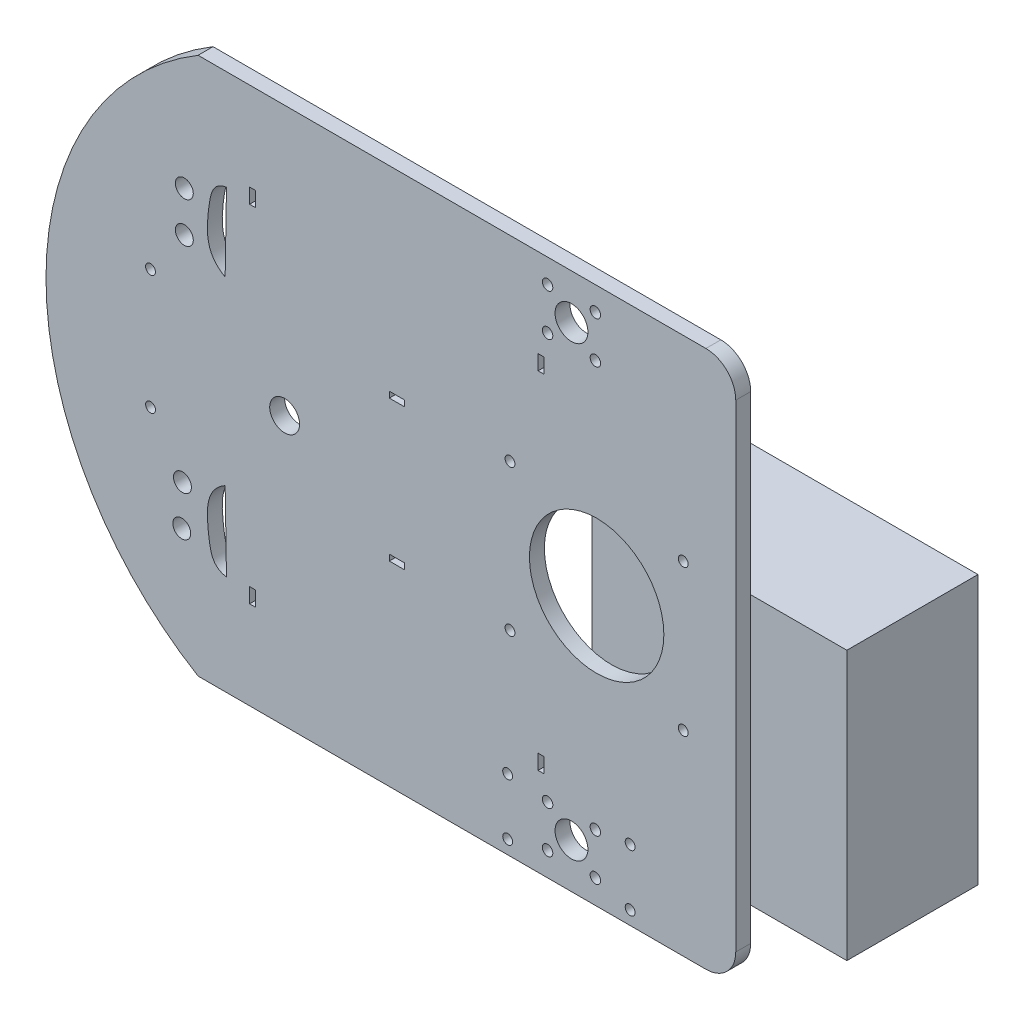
ISO-10303-21;
HEADER;
FILE_DESCRIPTION(('STEP AP214'),'2;1');
FILE_NAME('part.step','',(''),(''),'','','');
FILE_SCHEMA(('AUTOMOTIVE_DESIGN { 1 0 10303 214 1 1 1 1 }'));
ENDSEC;
DATA;
#1=APPLICATION_CONTEXT('core data for automotive mechanical design processes');
#2=APPLICATION_PROTOCOL_DEFINITION('international standard','automotive_design',2000,#1);
#3=PRODUCT_CONTEXT('',#1,'mechanical');
#4=PRODUCT('Part','Part','',(#3));
#5=PRODUCT_RELATED_PRODUCT_CATEGORY('part','',(#4));
#6=PRODUCT_DEFINITION_FORMATION('','',#4);
#7=PRODUCT_DEFINITION_CONTEXT('part definition',#1,'design');
#8=PRODUCT_DEFINITION('design','',#6,#7);
#9=PRODUCT_DEFINITION_SHAPE('','',#8);
#10=(LENGTH_UNIT() NAMED_UNIT(*) SI_UNIT(.MILLI.,.METRE.));
#11=(NAMED_UNIT(*) PLANE_ANGLE_UNIT() SI_UNIT($,.RADIAN.));
#12=(NAMED_UNIT(*) SI_UNIT($,.STERADIAN.) SOLID_ANGLE_UNIT());
#13=UNCERTAINTY_MEASURE_WITH_UNIT(LENGTH_MEASURE(1.E-05),#10,'distance_accuracy_value','');
#14=(GEOMETRIC_REPRESENTATION_CONTEXT(3) GLOBAL_UNCERTAINTY_ASSIGNED_CONTEXT((#13)) GLOBAL_UNIT_ASSIGNED_CONTEXT((#10,
#11,#12)) REPRESENTATION_CONTEXT('',''));
#15=CARTESIAN_POINT('',(0.,0.,0.));
#16=DIRECTION('',(0.,0.,1.));
#17=DIRECTION('',(1.,0.,0.));
#18=AXIS2_PLACEMENT_3D('',#15,#16,#17);
#19=CARTESIAN_POINT('',(-74.1896069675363,90.,-65.0075978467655));
#20=DIRECTION('',(1.,0.,0.));
#21=DIRECTION('',(0.,0.,-1.));
#22=AXIS2_PLACEMENT_3D('',#19,#20,#21);
#23=PLANE('',#22);
#24=DIRECTION('',(0.,0.,1.));
#25=VECTOR('',#24,1.);
#26=CARTESIAN_POINT('',(-74.1896069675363,0.,-65.0075978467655));
#27=LINE('',#26,#25);
#28=CARTESIAN_POINT('',(-74.1896069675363,0.,-65.0075978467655));
#29=VERTEX_POINT('',#28);
#30=CARTESIAN_POINT('',(-74.1896069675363,0.,-21.1016009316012));
#31=VERTEX_POINT('',#30);
#32=EDGE_CURVE('E116',#29,#31,#27,.T.);
#33=ORIENTED_EDGE('',*,*,#32,.T.);
#34=DIRECTION('',(0.,-1.,0.));
#35=VECTOR('',#34,1.);
#36=CARTESIAN_POINT('',(-74.1896069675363,90.,-21.1016009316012));
#37=LINE('',#36,#35);
#38=CARTESIAN_POINT('',(-74.1896069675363,90.,-21.1016009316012));
#39=VERTEX_POINT('',#38);
#40=EDGE_CURVE('E12',#39,#31,#37,.T.);
#41=ORIENTED_EDGE('',*,*,#40,.F.);
#42=DIRECTION('',(0.,0.,1.));
#43=VECTOR('',#42,1.);
#44=CARTESIAN_POINT('',(-74.1896069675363,90.,-65.0075978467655));
#45=LINE('',#44,#43);
#46=CARTESIAN_POINT('',(-74.1896069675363,90.,-65.0075978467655));
#47=VERTEX_POINT('',#46);
#48=EDGE_CURVE('E104',#47,#39,#45,.T.);
#49=ORIENTED_EDGE('',*,*,#48,.F.);
#50=DIRECTION('',(0.,-1.,0.));
#51=VECTOR('',#50,1.);
#52=CARTESIAN_POINT('',(-74.1896069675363,90.,-65.0075978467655));
#53=LINE('',#52,#51);
#54=EDGE_CURVE('E112',#47,#29,#53,.T.);
#55=ORIENTED_EDGE('',*,*,#54,.T.);
#56=EDGE_LOOP('',(#33,#41,#49,#55));
#57=FACE_BOUND('',#56,.T.);
#58=ADVANCED_FACE('F53',(#57),#23,.F.);
#59=CARTESIAN_POINT('',(-74.1896069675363,90.,-21.1016009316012));
#60=DIRECTION('',(0.,0.,-1.));
#61=DIRECTION('',(-1.,0.,0.));
#62=AXIS2_PLACEMENT_3D('',#59,#60,#61);
#63=PLANE('',#62);
#64=DIRECTION('',(1.,0.,0.));
#65=VECTOR('',#64,1.);
#66=CARTESIAN_POINT('',(-74.1896069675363,0.,-21.1016009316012));
#67=LINE('',#66,#65);
#68=CARTESIAN_POINT('',(11.0902773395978,0.,-21.1016009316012));
#69=VERTEX_POINT('',#68);
#70=EDGE_CURVE('E108',#31,#69,#67,.T.);
#71=ORIENTED_EDGE('',*,*,#70,.T.);
#72=DIRECTION('',(0.,-1.,0.));
#73=VECTOR('',#72,1.);
#74=CARTESIAN_POINT('',(11.0902773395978,90.,-21.1016009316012));
#75=LINE('',#74,#73);
#76=CARTESIAN_POINT('',(11.0902773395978,90.,-21.1016009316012));
#77=VERTEX_POINT('',#76);
#78=EDGE_CURVE('E61',#77,#69,#75,.T.);
#79=ORIENTED_EDGE('',*,*,#78,.F.);
#80=DIRECTION('',(1.,0.,0.));
#81=VECTOR('',#80,1.);
#82=CARTESIAN_POINT('',(-74.1896069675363,90.,-21.1016009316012));
#83=LINE('',#82,#81);
#84=EDGE_CURVE('E99',#39,#77,#83,.T.);
#85=ORIENTED_EDGE('',*,*,#84,.F.);
#86=ORIENTED_EDGE('',*,*,#40,.T.);
#87=EDGE_LOOP('',(#71,#79,#85,#86));
#88=FACE_BOUND('',#87,.T.);
#89=ADVANCED_FACE('F107',(#88),#63,.F.);
#90=CARTESIAN_POINT('',(11.0902773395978,90.,-65.0075978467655));
#91=DIRECTION('',(-1.,0.,0.));
#92=DIRECTION('',(0.,0.,1.));
#93=AXIS2_PLACEMENT_3D('',#90,#91,#92);
#94=PLANE('',#93);
#95=DIRECTION('',(0.,0.,-1.));
#96=VECTOR('',#95,1.);
#97=CARTESIAN_POINT('',(11.0902773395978,0.,-65.0075978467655));
#98=LINE('',#97,#96);
#99=CARTESIAN_POINT('',(11.0902773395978,0.,-65.0075978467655));
#100=VERTEX_POINT('',#99);
#101=EDGE_CURVE('E86',#69,#100,#98,.T.);
#102=ORIENTED_EDGE('',*,*,#101,.T.);
#103=DIRECTION('',(0.,-1.,0.));
#104=VECTOR('',#103,1.);
#105=CARTESIAN_POINT('',(11.0902773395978,90.,-65.0075978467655));
#106=LINE('',#105,#104);
#107=CARTESIAN_POINT('',(11.0902773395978,90.,-65.0075978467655));
#108=VERTEX_POINT('',#107);
#109=EDGE_CURVE('E109',#108,#100,#106,.T.);
#110=ORIENTED_EDGE('',*,*,#109,.F.);
#111=DIRECTION('',(0.,0.,-1.));
#112=VECTOR('',#111,1.);
#113=CARTESIAN_POINT('',(11.0902773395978,90.,-65.0075978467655));
#114=LINE('',#113,#112);
#115=EDGE_CURVE('E102',#77,#108,#114,.T.);
#116=ORIENTED_EDGE('',*,*,#115,.F.);
#117=ORIENTED_EDGE('',*,*,#78,.T.);
#118=EDGE_LOOP('',(#102,#110,#116,#117));
#119=FACE_BOUND('',#118,.T.);
#120=ADVANCED_FACE('F110',(#119),#94,.F.);
#121=CARTESIAN_POINT('',(-74.1896069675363,90.,-65.0075978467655));
#122=DIRECTION('',(0.,0.,1.));
#123=DIRECTION('',(1.,0.,0.));
#124=AXIS2_PLACEMENT_3D('',#121,#122,#123);
#125=PLANE('',#124);
#126=DIRECTION('',(-1.,0.,0.));
#127=VECTOR('',#126,1.);
#128=CARTESIAN_POINT('',(-74.1896069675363,0.,-65.0075978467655));
#129=LINE('',#128,#127);
#130=EDGE_CURVE('E92',#100,#29,#129,.T.);
#131=ORIENTED_EDGE('',*,*,#130,.T.);
#132=ORIENTED_EDGE('',*,*,#54,.F.);
#133=DIRECTION('',(-1.,0.,0.));
#134=VECTOR('',#133,1.);
#135=CARTESIAN_POINT('',(-74.1896069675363,90.,-65.0075978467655));
#136=LINE('',#135,#134);
#137=EDGE_CURVE('E69',#108,#47,#136,.T.);
#138=ORIENTED_EDGE('',*,*,#137,.F.);
#139=ORIENTED_EDGE('',*,*,#109,.T.);
#140=EDGE_LOOP('',(#131,#132,#138,#139));
#141=FACE_BOUND('',#140,.T.);
#142=ADVANCED_FACE('F123',(#141),#125,.F.);
#143=CARTESIAN_POINT('',(0.,90.,0.));
#144=DIRECTION('',(0.,1.,0.));
#145=DIRECTION('',(0.,0.,1.));
#146=AXIS2_PLACEMENT_3D('',#143,#144,#145);
#147=PLANE('',#146);
#148=ORIENTED_EDGE('',*,*,#48,.T.);
#149=ORIENTED_EDGE('',*,*,#84,.T.);
#150=ORIENTED_EDGE('',*,*,#115,.T.);
#151=ORIENTED_EDGE('',*,*,#137,.T.);
#152=EDGE_LOOP('',(#148,#149,#150,#151));
#153=FACE_BOUND('',#152,.T.);
#154=ADVANCED_FACE('F100',(#153),#147,.T.);
#155=CARTESIAN_POINT('',(0.,0.,0.));
#156=DIRECTION('',(0.,1.,0.));
#157=DIRECTION('',(0.,0.,1.));
#158=AXIS2_PLACEMENT_3D('',#155,#156,#157);
#159=PLANE('',#158);
#160=ORIENTED_EDGE('',*,*,#32,.F.);
#161=ORIENTED_EDGE('',*,*,#130,.F.);
#162=ORIENTED_EDGE('',*,*,#101,.F.);
#163=ORIENTED_EDGE('',*,*,#70,.F.);
#164=EDGE_LOOP('',(#160,#161,#162,#163));
#165=FACE_BOUND('',#164,.T.);
#166=ADVANCED_FACE('F126',(#165),#159,.F.);
#167=CLOSED_SHELL('',(#58,#89,#120,#142,#154,#166));
#168=MANIFOLD_SOLID_BREP('B2_NOT_SHOWN',#167);
#169=CARTESIAN_POINT('',(0.,0.,5.));
#170=DIRECTION('',(0.,0.,1.));
#171=DIRECTION('',(1.,0.,0.));
#172=AXIS2_PLACEMENT_3D('',#169,#170,#171);
#173=PLANE('',#172);
#174=CARTESIAN_POINT('',(-35.3599457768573,23.5205943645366,5.));
#175=DIRECTION('',(0.,0.,1.));
#176=DIRECTION('',(1.,0.,0.));
#177=AXIS2_PLACEMENT_3D('',#174,#175,#176);
#178=CIRCLE('',#177,1.65);
#179=CARTESIAN_POINT('',(-33.7099457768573,23.5205943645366,5.));
#180=VERTEX_POINT('',#179);
#181=EDGE_CURVE('E1664',#180,#180,#178,.T.);
#182=ORIENTED_EDGE('',*,*,#181,.F.);
#183=EDGE_LOOP('',(#182));
#184=FACE_BOUND('',#183,.T.);
#185=CARTESIAN_POINT('',(-76.3599457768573,4.55158242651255,5.));
#186=DIRECTION('',(0.,0.,1.));
#187=DIRECTION('',(1.,0.,0.));
#188=AXIS2_PLACEMENT_3D('',#185,#186,#187);
#189=CIRCLE('',#188,1.65);
#190=CARTESIAN_POINT('',(-74.7099457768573,4.55158242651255,5.));
#191=VERTEX_POINT('',#190);
#192=EDGE_CURVE('E1661',#191,#191,#189,.T.);
#193=ORIENTED_EDGE('',*,*,#192,.F.);
#194=EDGE_LOOP('',(#193));
#195=FACE_BOUND('',#194,.T.);
#196=CARTESIAN_POINT('',(-35.3599457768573,4.55158242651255,5.));
#197=DIRECTION('',(0.,0.,1.));
#198=DIRECTION('',(1.,0.,0.));
#199=AXIS2_PLACEMENT_3D('',#196,#197,#198);
#200=CIRCLE('',#199,1.65);
#201=CARTESIAN_POINT('',(-33.7099457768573,4.55158242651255,5.));
#202=VERTEX_POINT('',#201);
#203=EDGE_CURVE('E1654',#202,#202,#200,.T.);
#204=ORIENTED_EDGE('',*,*,#203,.F.);
#205=EDGE_LOOP('',(#204));
#206=FACE_BOUND('',#205,.T.);
#207=CARTESIAN_POINT('',(-76.3701057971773,23.5216103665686,5.));
#208=DIRECTION('',(0.,0.,1.));
#209=DIRECTION('',(1.,0.,0.));
#210=AXIS2_PLACEMENT_3D('',#207,#208,#209);
#211=CIRCLE('',#210,1.65);
#212=CARTESIAN_POINT('',(-74.7201057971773,23.5216103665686,5.));
#213=VERTEX_POINT('',#212);
#214=EDGE_CURVE('E741',#213,#213,#211,.T.);
#215=ORIENTED_EDGE('',*,*,#214,.F.);
#216=EDGE_LOOP('',(#215));
#217=FACE_BOUND('',#216,.T.);
#218=CARTESIAN_POINT('',(-46.5735210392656,90.0035048,5.));
#219=DIRECTION('',(0.,0.,1.));
#220=DIRECTION('',(1.,0.,0.));
#221=AXIS2_PLACEMENT_3D('',#218,#219,#220);
#222=CIRCLE('',#221,22.5);
#223=CARTESIAN_POINT('',(-24.0735210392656,90.0035048,5.));
#224=VERTEX_POINT('',#223);
#225=EDGE_CURVE('E762',#224,#224,#222,.T.);
#226=ORIENTED_EDGE('',*,*,#225,.F.);
#227=EDGE_LOOP('',(#226));
#228=FACE_BOUND('',#227,.T.);
#229=CARTESIAN_POINT('',(-151.026829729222,90.,5.));
#230=DIRECTION('',(0.,0.,1.));
#231=DIRECTION('',(1.,0.,0.));
#232=AXIS2_PLACEMENT_3D('',#229,#230,#231);
#233=CIRCLE('',#232,5.00000000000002);
#234=CARTESIAN_POINT('',(-146.026829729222,90.,5.));
#235=VERTEX_POINT('',#234);
#236=EDGE_CURVE('E720',#235,#235,#233,.T.);
#237=ORIENTED_EDGE('',*,*,#236,.F.);
#238=EDGE_LOOP('',(#237));
#239=FACE_BOUND('',#238,.T.);
#240=CARTESIAN_POINT('',(-184.607756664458,139.117368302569,5.));
#241=DIRECTION('',(0.,0.,1.));
#242=DIRECTION('',(1.,0.,0.));
#243=AXIS2_PLACEMENT_3D('',#240,#241,#242);
#244=CIRCLE('',#243,2.99999999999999);
#245=CARTESIAN_POINT('',(-181.607756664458,139.117368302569,5.));
#246=VERTEX_POINT('',#245);
#247=EDGE_CURVE('E706',#246,#246,#244,.T.);
#248=ORIENTED_EDGE('',*,*,#247,.F.);
#249=EDGE_LOOP('',(#248));
#250=FACE_BOUND('',#249,.T.);
#251=CARTESIAN_POINT('',(-184.607756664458,125.590830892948,5.));
#252=DIRECTION('',(0.,0.,1.));
#253=DIRECTION('',(1.,0.,0.));
#254=AXIS2_PLACEMENT_3D('',#251,#252,#253);
#255=CIRCLE('',#254,2.99999999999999);
#256=CARTESIAN_POINT('',(-181.607756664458,125.590830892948,5.));
#257=VERTEX_POINT('',#256);
#258=EDGE_CURVE('E769',#257,#257,#255,.T.);
#259=ORIENTED_EDGE('',*,*,#258,.F.);
#260=EDGE_LOOP('',(#259));
#261=FACE_BOUND('',#260,.T.);
#262=CARTESIAN_POINT('',(-185.23517581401,53.6073652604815,5.));
#263=DIRECTION('',(0.,0.,1.));
#264=DIRECTION('',(-1.,0.,0.));
#265=AXIS2_PLACEMENT_3D('',#262,#263,#264);
#266=CIRCLE('',#265,2.99999999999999);
#267=CARTESIAN_POINT('',(-188.23517581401,53.6073652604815,5.));
#268=VERTEX_POINT('',#267);
#269=EDGE_CURVE('E772',#268,#268,#266,.T.);
#270=ORIENTED_EDGE('',*,*,#269,.F.);
#271=EDGE_LOOP('',(#270));
#272=FACE_BOUND('',#271,.T.);
#273=CARTESIAN_POINT('',(-185.470956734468,40.0828829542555,5.));
#274=DIRECTION('',(0.,0.,1.));
#275=DIRECTION('',(-1.,0.,0.));
#276=AXIS2_PLACEMENT_3D('',#273,#274,#275);
#277=CIRCLE('',#276,3.);
#278=CARTESIAN_POINT('',(-188.470956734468,40.0828829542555,5.));
#279=VERTEX_POINT('',#278);
#280=EDGE_CURVE('E719',#279,#279,#277,.T.);
#281=ORIENTED_EDGE('',*,*,#280,.F.);
#282=EDGE_LOOP('',(#281));
#283=FACE_BOUND('',#282,.T.);
#284=DIRECTION('',(0.,-1.,0.));
#285=VECTOR('',#284,1.);
#286=CARTESIAN_POINT('',(-110.969679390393,112.622131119,5.));
#287=LINE('',#286,#285);
#288=CARTESIAN_POINT('',(-110.969679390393,114.622131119,5.));
#289=VERTEX_POINT('',#288);
#290=CARTESIAN_POINT('',(-110.969679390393,112.622131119,5.));
#291=VERTEX_POINT('',#290);
#292=EDGE_CURVE('E777',#289,#291,#287,.T.);
#293=ORIENTED_EDGE('',*,*,#292,.T.);
#294=DIRECTION('',(-1.,0.,0.));
#295=VECTOR('',#294,1.);
#296=CARTESIAN_POINT('',(-115.969679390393,112.622131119,5.));
#297=LINE('',#296,#295);
#298=CARTESIAN_POINT('',(-115.969679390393,112.622131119,5.));
#299=VERTEX_POINT('',#298);
#300=EDGE_CURVE('E780',#291,#299,#297,.T.);
#301=ORIENTED_EDGE('',*,*,#300,.T.);
#302=DIRECTION('',(0.,1.,0.));
#303=VECTOR('',#302,1.);
#304=CARTESIAN_POINT('',(-115.969679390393,112.622131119,5.));
#305=LINE('',#304,#303);
#306=CARTESIAN_POINT('',(-115.969679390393,114.622131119,5.));
#307=VERTEX_POINT('',#306);
#308=EDGE_CURVE('E784',#299,#307,#305,.T.);
#309=ORIENTED_EDGE('',*,*,#308,.T.);
#310=DIRECTION('',(1.,0.,0.));
#311=VECTOR('',#310,1.);
#312=CARTESIAN_POINT('',(-115.969679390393,114.622131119,5.));
#313=LINE('',#312,#311);
#314=EDGE_CURVE('E787',#307,#289,#313,.T.);
#315=ORIENTED_EDGE('',*,*,#314,.T.);
#316=EDGE_LOOP('',(#293,#301,#309,#315));
#317=FACE_BOUND('',#316,.T.);
#318=DIRECTION('',(0.,1.,0.));
#319=VECTOR('',#318,1.);
#320=CARTESIAN_POINT('',(-115.969679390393,67.3778688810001,5.));
#321=LINE('',#320,#319);
#322=CARTESIAN_POINT('',(-115.969679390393,65.3778688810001,5.));
#323=VERTEX_POINT('',#322);
#324=CARTESIAN_POINT('',(-115.969679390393,67.3778688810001,5.));
#325=VERTEX_POINT('',#324);
#326=EDGE_CURVE('E824',#323,#325,#321,.T.);
#327=ORIENTED_EDGE('',*,*,#326,.T.);
#328=DIRECTION('',(1.,0.,0.));
#329=VECTOR('',#328,1.);
#330=CARTESIAN_POINT('',(-115.969679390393,67.3778688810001,5.));
#331=LINE('',#330,#329);
#332=CARTESIAN_POINT('',(-110.969679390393,67.3778688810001,5.));
#333=VERTEX_POINT('',#332);
#334=EDGE_CURVE('E836',#325,#333,#331,.T.);
#335=ORIENTED_EDGE('',*,*,#334,.T.);
#336=DIRECTION('',(0.,-1.,0.));
#337=VECTOR('',#336,1.);
#338=CARTESIAN_POINT('',(-110.969679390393,67.3778688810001,5.));
#339=LINE('',#338,#337);
#340=CARTESIAN_POINT('',(-110.969679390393,65.3778688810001,5.));
#341=VERTEX_POINT('',#340);
#342=EDGE_CURVE('E833',#333,#341,#339,.T.);
#343=ORIENTED_EDGE('',*,*,#342,.T.);
#344=DIRECTION('',(-1.,0.,0.));
#345=VECTOR('',#344,1.);
#346=CARTESIAN_POINT('',(-115.969679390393,65.3778688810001,5.));
#347=LINE('',#346,#345);
#348=EDGE_CURVE('E814',#341,#323,#347,.T.);
#349=ORIENTED_EDGE('',*,*,#348,.T.);
#350=EDGE_LOOP('',(#327,#335,#343,#349));
#351=FACE_BOUND('',#350,.T.);
#352=DIRECTION('',(0.,1.,0.));
#353=VECTOR('',#352,1.);
#354=CARTESIAN_POINT('',(-66.169673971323,34.5789524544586,5.));
#355=LINE('',#354,#353);
#356=CARTESIAN_POINT('',(-66.169673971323,29.5789524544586,5.));
#357=VERTEX_POINT('',#356);
#358=CARTESIAN_POINT('',(-66.169673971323,34.5789524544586,5.));
#359=VERTEX_POINT('',#358);
#360=EDGE_CURVE('E888',#357,#359,#355,.T.);
#361=ORIENTED_EDGE('',*,*,#360,.T.);
#362=DIRECTION('',(1.,0.,0.));
#363=VECTOR('',#362,1.);
#364=CARTESIAN_POINT('',(-64.169673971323,34.5789524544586,5.));
#365=LINE('',#364,#363);
#366=CARTESIAN_POINT('',(-64.169673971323,34.5789524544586,5.));
#367=VERTEX_POINT('',#366);
#368=EDGE_CURVE('E900',#359,#367,#365,.T.);
#369=ORIENTED_EDGE('',*,*,#368,.T.);
#370=DIRECTION('',(0.,-1.,0.));
#371=VECTOR('',#370,1.);
#372=CARTESIAN_POINT('',(-64.169673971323,29.5789524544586,5.));
#373=LINE('',#372,#371);
#374=CARTESIAN_POINT('',(-64.169673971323,29.5789524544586,5.));
#375=VERTEX_POINT('',#374);
#376=EDGE_CURVE('E897',#367,#375,#373,.T.);
#377=ORIENTED_EDGE('',*,*,#376,.T.);
#378=DIRECTION('',(-1.,0.,0.));
#379=VECTOR('',#378,1.);
#380=CARTESIAN_POINT('',(-66.169673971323,29.5789524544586,5.));
#381=LINE('',#380,#379);
#382=EDGE_CURVE('E878',#375,#357,#381,.T.);
#383=ORIENTED_EDGE('',*,*,#382,.T.);
#384=EDGE_LOOP('',(#361,#369,#377,#383));
#385=FACE_BOUND('',#384,.T.);
#386=DIRECTION('',(0.,1.,0.));
#387=VECTOR('',#386,1.);
#388=CARTESIAN_POINT('',(-162.769673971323,34.5789524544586,5.));
#389=LINE('',#388,#387);
#390=CARTESIAN_POINT('',(-162.769673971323,29.5789524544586,5.));
#391=VERTEX_POINT('',#390);
#392=CARTESIAN_POINT('',(-162.769673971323,34.5789524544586,5.));
#393=VERTEX_POINT('',#392);
#394=EDGE_CURVE('E856',#391,#393,#389,.T.);
#395=ORIENTED_EDGE('',*,*,#394,.T.);
#396=DIRECTION('',(1.,0.,0.));
#397=VECTOR('',#396,1.);
#398=CARTESIAN_POINT('',(-160.769673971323,34.5789524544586,5.));
#399=LINE('',#398,#397);
#400=CARTESIAN_POINT('',(-160.769673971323,34.5789524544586,5.));
#401=VERTEX_POINT('',#400);
#402=EDGE_CURVE('E870',#393,#401,#399,.T.);
#403=ORIENTED_EDGE('',*,*,#402,.T.);
#404=DIRECTION('',(0.,-1.,0.));
#405=VECTOR('',#404,1.);
#406=CARTESIAN_POINT('',(-160.769673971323,29.5789524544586,5.));
#407=LINE('',#406,#405);
#408=CARTESIAN_POINT('',(-160.769673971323,29.5789524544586,5.));
#409=VERTEX_POINT('',#408);
#410=EDGE_CURVE('E867',#401,#409,#407,.T.);
#411=ORIENTED_EDGE('',*,*,#410,.T.);
#412=DIRECTION('',(-1.,0.,0.));
#413=VECTOR('',#412,1.);
#414=CARTESIAN_POINT('',(-162.769673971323,29.5789524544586,5.));
#415=LINE('',#414,#413);
#416=EDGE_CURVE('E844',#409,#391,#415,.T.);
#417=ORIENTED_EDGE('',*,*,#416,.T.);
#418=EDGE_LOOP('',(#395,#403,#411,#417));
#419=FACE_BOUND('',#418,.T.);
#420=DIRECTION('',(1.,0.,0.));
#421=VECTOR('',#420,1.);
#422=CARTESIAN_POINT('',(-66.169673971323,150.421047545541,5.));
#423=LINE('',#422,#421);
#424=CARTESIAN_POINT('',(-66.169673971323,150.421047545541,5.));
#425=VERTEX_POINT('',#424);
#426=CARTESIAN_POINT('',(-64.169673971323,150.421047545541,5.));
#427=VERTEX_POINT('',#426);
#428=EDGE_CURVE('E952',#425,#427,#423,.T.);
#429=ORIENTED_EDGE('',*,*,#428,.T.);
#430=DIRECTION('',(0.,-1.,0.));
#431=VECTOR('',#430,1.);
#432=CARTESIAN_POINT('',(-64.169673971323,150.421047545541,5.));
#433=LINE('',#432,#431);
#434=CARTESIAN_POINT('',(-64.169673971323,145.421047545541,5.));
#435=VERTEX_POINT('',#434);
#436=EDGE_CURVE('E963',#427,#435,#433,.T.);
#437=ORIENTED_EDGE('',*,*,#436,.T.);
#438=DIRECTION('',(1.,0.,0.));
#439=VECTOR('',#438,1.);
#440=CARTESIAN_POINT('',(-66.169673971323,145.421047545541,5.));
#441=LINE('',#440,#439);
#442=CARTESIAN_POINT('',(-66.169673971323,145.421047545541,5.));
#443=VERTEX_POINT('',#442);
#444=EDGE_CURVE('E960',#443,#435,#441,.T.);
#445=ORIENTED_EDGE('',*,*,#444,.F.);
#446=DIRECTION('',(0.,-1.,0.));
#447=VECTOR('',#446,1.);
#448=CARTESIAN_POINT('',(-66.169673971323,150.421047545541,5.));
#449=LINE('',#448,#447);
#450=EDGE_CURVE('E942',#425,#443,#449,.T.);
#451=ORIENTED_EDGE('',*,*,#450,.F.);
#452=EDGE_LOOP('',(#429,#437,#445,#451));
#453=FACE_BOUND('',#452,.T.);
#454=CARTESIAN_POINT('',(-75.5735265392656,65.5052048,5.));
#455=DIRECTION('',(0.,0.,1.));
#456=DIRECTION('',(1.,0.,0.));
#457=AXIS2_PLACEMENT_3D('',#454,#455,#456);
#458=CIRCLE('',#457,1.65000000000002);
#459=CARTESIAN_POINT('',(-73.9235265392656,65.5052048,5.));
#460=VERTEX_POINT('',#459);
#461=EDGE_CURVE('E981',#460,#460,#458,.T.);
#462=ORIENTED_EDGE('',*,*,#461,.F.);
#463=EDGE_LOOP('',(#462));
#464=FACE_BOUND('',#463,.T.);
#465=CARTESIAN_POINT('',(-17.5735155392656,65.5052048,5.));
#466=DIRECTION('',(0.,0.,1.));
#467=DIRECTION('',(1.,0.,0.));
#468=AXIS2_PLACEMENT_3D('',#465,#466,#467);
#469=CIRCLE('',#468,1.65);
#470=CARTESIAN_POINT('',(-15.9235155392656,65.5052048,5.));
#471=VERTEX_POINT('',#470);
#472=EDGE_CURVE('E975',#471,#471,#469,.T.);
#473=ORIENTED_EDGE('',*,*,#472,.F.);
#474=EDGE_LOOP('',(#473));
#475=FACE_BOUND('',#474,.T.);
#476=CARTESIAN_POINT('',(-17.5735155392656,114.5018048,5.));
#477=DIRECTION('',(0.,0.,1.));
#478=DIRECTION('',(1.,0.,0.));
#479=AXIS2_PLACEMENT_3D('',#476,#477,#478);
#480=CIRCLE('',#479,1.65000000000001);
#481=CARTESIAN_POINT('',(-15.9235155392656,114.5018048,5.));
#482=VERTEX_POINT('',#481);
#483=EDGE_CURVE('E968',#482,#482,#480,.T.);
#484=ORIENTED_EDGE('',*,*,#483,.F.);
#485=EDGE_LOOP('',(#484));
#486=FACE_BOUND('',#485,.T.);
#487=CARTESIAN_POINT('',(-75.5735265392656,114.5018048,5.));
#488=DIRECTION('',(0.,0.,1.));
#489=DIRECTION('',(1.,0.,0.));
#490=AXIS2_PLACEMENT_3D('',#487,#488,#489);
#491=CIRCLE('',#490,1.65000000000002);
#492=CARTESIAN_POINT('',(-73.9235265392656,114.5018048,5.));
#493=VERTEX_POINT('',#492);
#494=EDGE_CURVE('E971',#493,#493,#491,.T.);
#495=ORIENTED_EDGE('',*,*,#494,.F.);
#496=EDGE_LOOP('',(#495));
#497=FACE_BOUND('',#496,.T.);
#498=CARTESIAN_POINT('',(-55.,165.,5.));
#499=DIRECTION('',(0.,0.,1.));
#500=DIRECTION('',(1.,0.,0.));
#501=AXIS2_PLACEMENT_3D('',#498,#499,#500);
#502=CIRCLE('',#501,5.5);
#503=CARTESIAN_POINT('',(-49.5,165.,5.));
#504=VERTEX_POINT('',#503);
#505=EDGE_CURVE('E1048',#504,#504,#502,.T.);
#506=ORIENTED_EDGE('',*,*,#505,.F.);
#507=EDGE_LOOP('',(#506));
#508=FACE_BOUND('',#507,.T.);
#509=CARTESIAN_POINT('',(-63.0000000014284,158.000000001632,5.));
#510=DIRECTION('',(0.,0.,1.));
#511=DIRECTION('',(1.,0.,0.));
#512=AXIS2_PLACEMENT_3D('',#509,#510,#511);
#513=CIRCLE('',#512,1.75);
#514=CARTESIAN_POINT('',(-61.2500000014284,158.000000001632,5.));
#515=VERTEX_POINT('',#514);
#516=EDGE_CURVE('E1045',#515,#515,#513,.T.);
#517=ORIENTED_EDGE('',*,*,#516,.F.);
#518=EDGE_LOOP('',(#517));
#519=FACE_BOUND('',#518,.T.);
#520=CARTESIAN_POINT('',(-62.9999999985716,172.000000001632,5.));
#521=DIRECTION('',(0.,0.,1.));
#522=DIRECTION('',(1.,0.,0.));
#523=AXIS2_PLACEMENT_3D('',#520,#521,#522);
#524=CIRCLE('',#523,1.75);
#525=CARTESIAN_POINT('',(-61.2499999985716,172.000000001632,5.));
#526=VERTEX_POINT('',#525);
#527=EDGE_CURVE('E1042',#526,#526,#524,.T.);
#528=ORIENTED_EDGE('',*,*,#527,.F.);
#529=EDGE_LOOP('',(#528));
#530=FACE_BOUND('',#529,.T.);
#531=CARTESIAN_POINT('',(-46.9999999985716,171.999999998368,5.));
#532=DIRECTION('',(0.,0.,1.));
#533=DIRECTION('',(1.,0.,0.));
#534=AXIS2_PLACEMENT_3D('',#531,#532,#533);
#535=CIRCLE('',#534,1.75);
#536=CARTESIAN_POINT('',(-45.2499999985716,171.999999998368,5.));
#537=VERTEX_POINT('',#536);
#538=EDGE_CURVE('E1039',#537,#537,#535,.T.);
#539=ORIENTED_EDGE('',*,*,#538,.F.);
#540=EDGE_LOOP('',(#539));
#541=FACE_BOUND('',#540,.T.);
#542=CARTESIAN_POINT('',(-55.,15.,5.));
#543=DIRECTION('',(0.,0.,1.));
#544=DIRECTION('',(1.,0.,0.));
#545=AXIS2_PLACEMENT_3D('',#542,#543,#544);
#546=CIRCLE('',#545,5.5);
#547=CARTESIAN_POINT('',(-49.5,15.,5.));
#548=VERTEX_POINT('',#547);
#549=EDGE_CURVE('E1036',#548,#548,#546,.T.);
#550=ORIENTED_EDGE('',*,*,#549,.F.);
#551=EDGE_LOOP('',(#550));
#552=FACE_BOUND('',#551,.T.);
#553=CARTESIAN_POINT('',(-47.0000000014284,22.0000000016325,5.));
#554=DIRECTION('',(0.,0.,1.));
#555=DIRECTION('',(1.,0.,0.));
#556=AXIS2_PLACEMENT_3D('',#553,#554,#555);
#557=CIRCLE('',#556,1.75);
#558=CARTESIAN_POINT('',(-45.2500000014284,22.0000000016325,5.));
#559=VERTEX_POINT('',#558);
#560=EDGE_CURVE('E1033',#559,#559,#557,.T.);
#561=ORIENTED_EDGE('',*,*,#560,.F.);
#562=EDGE_LOOP('',(#561));
#563=FACE_BOUND('',#562,.T.);
#564=CARTESIAN_POINT('',(-63.0000000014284,21.9999999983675,5.));
#565=DIRECTION('',(0.,0.,1.));
#566=DIRECTION('',(1.,0.,0.));
#567=AXIS2_PLACEMENT_3D('',#564,#565,#566);
#568=CIRCLE('',#567,1.75);
#569=CARTESIAN_POINT('',(-61.2500000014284,21.9999999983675,5.));
#570=VERTEX_POINT('',#569);
#571=EDGE_CURVE('E1030',#570,#570,#568,.T.);
#572=ORIENTED_EDGE('',*,*,#571,.F.);
#573=EDGE_LOOP('',(#572));
#574=FACE_BOUND('',#573,.T.);
#575=CARTESIAN_POINT('',(-62.9999999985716,7.99999999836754,5.));
#576=DIRECTION('',(0.,0.,1.));
#577=DIRECTION('',(1.,0.,0.));
#578=AXIS2_PLACEMENT_3D('',#575,#576,#577);
#579=CIRCLE('',#578,1.75);
#580=CARTESIAN_POINT('',(-61.2499999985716,7.99999999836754,5.));
#581=VERTEX_POINT('',#580);
#582=EDGE_CURVE('E1027',#581,#581,#579,.T.);
#583=ORIENTED_EDGE('',*,*,#582,.F.);
#584=EDGE_LOOP('',(#583));
#585=FACE_BOUND('',#584,.T.);
#586=CARTESIAN_POINT('',(-46.9999999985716,8.00000000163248,5.));
#587=DIRECTION('',(0.,0.,1.));
#588=DIRECTION('',(1.,0.,0.));
#589=AXIS2_PLACEMENT_3D('',#586,#587,#588);
#590=CIRCLE('',#589,1.75);
#591=CARTESIAN_POINT('',(-45.2499999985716,8.00000000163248,5.));
#592=VERTEX_POINT('',#591);
#593=EDGE_CURVE('E1024',#592,#592,#590,.T.);
#594=ORIENTED_EDGE('',*,*,#593,.F.);
#595=EDGE_LOOP('',(#594));
#596=FACE_BOUND('',#595,.T.);
#597=CARTESIAN_POINT('',(-47.0000000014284,157.999999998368,5.));
#598=DIRECTION('',(0.,0.,1.));
#599=DIRECTION('',(1.,0.,0.));
#600=AXIS2_PLACEMENT_3D('',#597,#598,#599);
#601=CIRCLE('',#600,1.75);
#602=CARTESIAN_POINT('',(-45.2500000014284,157.999999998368,5.));
#603=VERTEX_POINT('',#602);
#604=EDGE_CURVE('E1021',#603,#603,#601,.T.);
#605=ORIENTED_EDGE('',*,*,#604,.F.);
#606=EDGE_LOOP('',(#605));
#607=FACE_BOUND('',#606,.T.);
#608=CARTESIAN_POINT('',(-195.91673086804,110.,5.));
#609=DIRECTION('',(0.,0.,1.));
#610=DIRECTION('',(1.,0.,0.));
#611=AXIS2_PLACEMENT_3D('',#608,#609,#610);
#612=CIRCLE('',#611,1.65000000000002);
#613=CARTESIAN_POINT('',(-194.26673086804,110.,5.));
#614=VERTEX_POINT('',#613);
#615=EDGE_CURVE('E1055',#614,#614,#612,.T.);
#616=ORIENTED_EDGE('',*,*,#615,.F.);
#617=EDGE_LOOP('',(#616));
#618=FACE_BOUND('',#617,.T.);
#619=CARTESIAN_POINT('',(-195.91673086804,70.,5.));
#620=DIRECTION('',(0.,0.,1.));
#621=DIRECTION('',(-1.,0.,0.));
#622=AXIS2_PLACEMENT_3D('',#619,#620,#621);
#623=CIRCLE('',#622,1.64999999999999);
#624=CARTESIAN_POINT('',(-197.56673086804,70.,5.));
#625=VERTEX_POINT('',#624);
#626=EDGE_CURVE('E1058',#625,#625,#623,.T.);
#627=ORIENTED_EDGE('',*,*,#626,.F.);
#628=EDGE_LOOP('',(#627));
#629=FACE_BOUND('',#628,.T.);
#630=DIRECTION('',(1.,0.,0.));
#631=VECTOR('',#630,1.);
#632=CARTESIAN_POINT('',(0.,180.,5.));
#633=LINE('',#632,#631);
#634=CARTESIAN_POINT('',(-180.,180.,5.));
#635=VERTEX_POINT('',#634);
#636=CARTESIAN_POINT('',(-9.99999999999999,180.,5.));
#637=VERTEX_POINT('',#636);
#638=EDGE_CURVE('E689',#635,#637,#633,.T.);
#639=ORIENTED_EDGE('',*,*,#638,.F.);
#640=CARTESIAN_POINT('',(-125.91673086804,90.,5.));
#641=DIRECTION('',(0.,0.,1.));
#642=DIRECTION('',(1.,0.,0.));
#643=AXIS2_PLACEMENT_3D('',#640,#641,#642);
#644=CIRCLE('',#643,105.);
#645=CARTESIAN_POINT('',(-180.,0.,5.));
#646=VERTEX_POINT('',#645);
#647=EDGE_CURVE('E1065',#635,#646,#644,.T.);
#648=ORIENTED_EDGE('',*,*,#647,.T.);
#649=DIRECTION('',(-1.,0.,0.));
#650=VECTOR('',#649,1.);
#651=CARTESIAN_POINT('',(0.,0.,5.));
#652=LINE('',#651,#650);
#653=CARTESIAN_POINT('',(-10.0000000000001,0.,5.));
#654=VERTEX_POINT('',#653);
#655=EDGE_CURVE('E1067',#654,#646,#652,.T.);
#656=ORIENTED_EDGE('',*,*,#655,.F.);
#657=CARTESIAN_POINT('',(-10.,10.,5.));
#658=DIRECTION('',(0.,0.,1.));
#659=DIRECTION('',(1.,0.,0.));
#660=AXIS2_PLACEMENT_3D('',#657,#658,#659);
#661=CIRCLE('',#660,10.);
#662=CARTESIAN_POINT('',(0.,10.0000000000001,5.));
#663=VERTEX_POINT('',#662);
#664=EDGE_CURVE('E1069',#654,#663,#661,.T.);
#665=ORIENTED_EDGE('',*,*,#664,.T.);
#666=DIRECTION('',(0.,-1.,0.));
#667=VECTOR('',#666,1.);
#668=CARTESIAN_POINT('',(0.,0.,5.));
#669=LINE('',#668,#667);
#670=CARTESIAN_POINT('',(0.,170.,5.));
#671=VERTEX_POINT('',#670);
#672=EDGE_CURVE('E1071',#671,#663,#669,.T.);
#673=ORIENTED_EDGE('',*,*,#672,.F.);
#674=CARTESIAN_POINT('',(-9.99999999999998,170.,5.));
#675=DIRECTION('',(0.,0.,1.));
#676=DIRECTION('',(1.,0.,0.));
#677=AXIS2_PLACEMENT_3D('',#674,#675,#676);
#678=CIRCLE('',#677,10.);
#679=EDGE_CURVE('E693',#637,#671,#678,.F.);
#680=ORIENTED_EDGE('',*,*,#679,.F.);
#681=EDGE_LOOP('',(#639,#648,#656,#665,#673,#680));
#682=FACE_BOUND('',#681,.T.);
#683=DIRECTION('',(0.,-1.,0.));
#684=VECTOR('',#683,1.);
#685=CARTESIAN_POINT('',(-162.769673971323,0.,5.));
#686=LINE('',#685,#684);
#687=CARTESIAN_POINT('',(-162.769673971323,150.421047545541,5.));
#688=VERTEX_POINT('',#687);
#689=CARTESIAN_POINT('',(-162.769673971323,145.421047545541,5.));
#690=VERTEX_POINT('',#689);
#691=EDGE_CURVE('E914',#688,#690,#686,.T.);
#692=ORIENTED_EDGE('',*,*,#691,.F.);
#693=DIRECTION('',(-1.,0.,0.));
#694=VECTOR('',#693,1.);
#695=CARTESIAN_POINT('',(0.,150.421047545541,5.));
#696=LINE('',#695,#694);
#697=CARTESIAN_POINT('',(-160.769673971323,150.421047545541,5.));
#698=VERTEX_POINT('',#697);
#699=EDGE_CURVE('E905',#698,#688,#696,.T.);
#700=ORIENTED_EDGE('',*,*,#699,.F.);
#701=DIRECTION('',(0.,-1.,0.));
#702=VECTOR('',#701,1.);
#703=CARTESIAN_POINT('',(-160.769673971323,0.,5.));
#704=LINE('',#703,#702);
#705=CARTESIAN_POINT('',(-160.769673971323,145.421047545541,5.));
#706=VERTEX_POINT('',#705);
#707=EDGE_CURVE('E907',#698,#706,#704,.T.);
#708=ORIENTED_EDGE('',*,*,#707,.T.);
#709=DIRECTION('',(-1.,0.,0.));
#710=VECTOR('',#709,1.);
#711=CARTESIAN_POINT('',(0.,145.421047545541,5.));
#712=LINE('',#711,#710);
#713=EDGE_CURVE('E911',#706,#690,#712,.T.);
#714=ORIENTED_EDGE('',*,*,#713,.T.);
#715=EDGE_LOOP('',(#692,#700,#708,#714));
#716=FACE_BOUND('',#715,.T.);
#717=CARTESIAN_POINT('',(-170.486475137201,146.497749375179,5.));
#718=CARTESIAN_POINT('',(-175.137657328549,145.836664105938,5.));
#719=CARTESIAN_POINT('',(-177.02819300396,135.077918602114,5.));
#720=CARTESIAN_POINT('',(-177.863007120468,124.064655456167,5.));
#721=CARTESIAN_POINT('',(-170.939704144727,120.23570546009,5.));
#722=B_SPLINE_CURVE_WITH_KNOTS('',3,(#717,#718,#719,#720,#721),.UNSPECIFIED.,.F.,.F.,(4,1,4),
(0.,0.355909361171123,1.),.UNSPECIFIED.);
#723=CARTESIAN_POINT('',(-170.497148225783,146.496225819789,5.));
#724=VERTEX_POINT('',#723);
#725=CARTESIAN_POINT('',(-170.939704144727,120.23570546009,5.));
#726=VERTEX_POINT('',#725);
#727=EDGE_CURVE('E749',#724,#726,#722,.T.);
#728=ORIENTED_EDGE('',*,*,#727,.F.);
#729=DIRECTION('',(-0.016850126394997,-0.999858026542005,0.));
#730=VECTOR('',#729,1.);
#731=CARTESIAN_POINT('',(-172.916868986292,2.91408482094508,5.));
#732=LINE('',#731,#730);
#733=EDGE_CURVE('E201',#724,#726,#732,.T.);
#734=ORIENTED_EDGE('',*,*,#733,.T.);
#735=EDGE_LOOP('',(#728,#734));
#736=FACE_BOUND('',#735,.T.);
#737=DIRECTION('',(-0.016850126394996,0.999858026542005,0.));
#738=VECTOR('',#737,1.);
#739=CARTESIAN_POINT('',(-169.884276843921,-2.86297800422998,5.));
#740=LINE('',#739,#738);
#741=CARTESIAN_POINT('',(-170.497148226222,33.5037741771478,5.));
#742=VERTEX_POINT('',#741);
#743=CARTESIAN_POINT('',(-170.939704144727,59.7642945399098,5.));
#744=VERTEX_POINT('',#743);
#745=EDGE_CURVE('E408',#742,#744,#740,.T.);
#746=ORIENTED_EDGE('',*,*,#745,.F.);
#747=CARTESIAN_POINT('',(-170.486475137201,33.502250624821,5.));
#748=CARTESIAN_POINT('',(-175.137657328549,34.1633358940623,5.));
#749=CARTESIAN_POINT('',(-177.02819300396,44.9220813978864,5.));
#750=CARTESIAN_POINT('',(-177.863007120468,55.9353445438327,5.));
#751=CARTESIAN_POINT('',(-170.939704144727,59.7642945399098,5.));
#752=B_SPLINE_CURVE_WITH_KNOTS('',3,(#747,#748,#749,#750,#751),.UNSPECIFIED.,.F.,.F.,(4,1,4),
(0.,0.355909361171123,1.),.UNSPECIFIED.);
#753=EDGE_CURVE('E193',#742,#744,#752,.T.);
#754=ORIENTED_EDGE('',*,*,#753,.T.);
#755=EDGE_LOOP('',(#746,#754));
#756=FACE_BOUND('',#755,.T.);
#757=ADVANCED_FACE('F176',(#184,#195,#206,#217,#228,#239,#250,#261,#272,#283,#317,#351,#385,
#419,#453,#464,#475,#486,#497,#508,#519,#530,#541,#552,#563,#574,#585,#596,#607,#618,#629,#682,
#716,#736,#756),#173,.T.);
#758=CARTESIAN_POINT('',(0.,0.,0.));
#759=DIRECTION('',(0.,0.,1.));
#760=DIRECTION('',(1.,0.,0.));
#761=AXIS2_PLACEMENT_3D('',#758,#759,#760);
#762=PLANE('',#761);
#763=CARTESIAN_POINT('',(-35.3599457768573,23.5205943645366,0.));
#764=DIRECTION('',(0.,0.,1.));
#765=DIRECTION('',(1.,0.,0.));
#766=AXIS2_PLACEMENT_3D('',#763,#764,#765);
#767=CIRCLE('',#766,1.65);
#768=CARTESIAN_POINT('',(-33.7099457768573,23.5205943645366,0.));
#769=VERTEX_POINT('',#768);
#770=EDGE_CURVE('E180',#769,#769,#767,.T.);
#771=ORIENTED_EDGE('',*,*,#770,.T.);
#772=EDGE_LOOP('',(#771));
#773=FACE_BOUND('',#772,.T.);
#774=CARTESIAN_POINT('',(-76.3599457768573,4.55158242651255,0.));
#775=DIRECTION('',(0.,0.,1.));
#776=DIRECTION('',(1.,0.,0.));
#777=AXIS2_PLACEMENT_3D('',#774,#775,#776);
#778=CIRCLE('',#777,1.65);
#779=CARTESIAN_POINT('',(-74.7099457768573,4.55158242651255,0.));
#780=VERTEX_POINT('',#779);
#781=EDGE_CURVE('E743',#780,#780,#778,.T.);
#782=ORIENTED_EDGE('',*,*,#781,.T.);
#783=EDGE_LOOP('',(#782));
#784=FACE_BOUND('',#783,.T.);
#785=CARTESIAN_POINT('',(-35.3599457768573,4.55158242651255,0.));
#786=DIRECTION('',(0.,0.,1.));
#787=DIRECTION('',(1.,0.,0.));
#788=AXIS2_PLACEMENT_3D('',#785,#786,#787);
#789=CIRCLE('',#788,1.65);
#790=CARTESIAN_POINT('',(-33.7099457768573,4.55158242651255,0.));
#791=VERTEX_POINT('',#790);
#792=EDGE_CURVE('E740',#791,#791,#789,.T.);
#793=ORIENTED_EDGE('',*,*,#792,.T.);
#794=EDGE_LOOP('',(#793));
#795=FACE_BOUND('',#794,.T.);
#796=CARTESIAN_POINT('',(-76.3701057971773,23.5216103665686,0.));
#797=DIRECTION('',(0.,0.,1.));
#798=DIRECTION('',(1.,0.,0.));
#799=AXIS2_PLACEMENT_3D('',#796,#797,#798);
#800=CIRCLE('',#799,1.65);
#801=CARTESIAN_POINT('',(-74.7201057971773,23.5216103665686,0.));
#802=VERTEX_POINT('',#801);
#803=EDGE_CURVE('E734',#802,#802,#800,.T.);
#804=ORIENTED_EDGE('',*,*,#803,.T.);
#805=EDGE_LOOP('',(#804));
#806=FACE_BOUND('',#805,.T.);
#807=DIRECTION('',(-0.016850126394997,-0.999858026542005,0.));
#808=VECTOR('',#807,1.);
#809=CARTESIAN_POINT('',(-172.916868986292,2.91408482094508,0.));
#810=LINE('',#809,#808);
#811=CARTESIAN_POINT('',(-170.497148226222,146.496225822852,0.));
#812=VERTEX_POINT('',#811);
#813=CARTESIAN_POINT('',(-170.939704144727,120.23570546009,0.));
#814=VERTEX_POINT('',#813);
#815=EDGE_CURVE('E725',#812,#814,#810,.T.);
#816=ORIENTED_EDGE('',*,*,#815,.F.);
#817=CARTESIAN_POINT('',(-170.486475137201,146.497749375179,0.));
#818=CARTESIAN_POINT('',(-175.137657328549,145.836664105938,0.));
#819=CARTESIAN_POINT('',(-177.02819300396,135.077918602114,0.));
#820=CARTESIAN_POINT('',(-177.863007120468,124.064655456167,0.));
#821=CARTESIAN_POINT('',(-170.939704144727,120.23570546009,0.));
#822=B_SPLINE_CURVE_WITH_KNOTS('',3,(#817,#818,#819,#820,#821),.UNSPECIFIED.,.F.,.F.,(4,1,4),
(0.,0.355909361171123,1.),.UNSPECIFIED.);
#823=EDGE_CURVE('E701',#812,#814,#822,.T.);
#824=ORIENTED_EDGE('',*,*,#823,.T.);
#825=EDGE_LOOP('',(#816,#824));
#826=FACE_BOUND('',#825,.T.);
#827=CARTESIAN_POINT('',(-46.5735210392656,90.0035048,0.));
#828=DIRECTION('',(0.,0.,-1.));
#829=DIRECTION('',(-1.,0.,0.));
#830=AXIS2_PLACEMENT_3D('',#827,#828,#829);
#831=CIRCLE('',#830,22.5);
#832=CARTESIAN_POINT('',(-69.0735210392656,90.0035048,0.));
#833=VERTEX_POINT('',#832);
#834=EDGE_CURVE('E404',#833,#833,#831,.T.);
#835=ORIENTED_EDGE('',*,*,#834,.F.);
#836=EDGE_LOOP('',(#835));
#837=FACE_BOUND('',#836,.T.);
#838=CARTESIAN_POINT('',(-151.026829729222,90.,0.));
#839=DIRECTION('',(0.,0.,1.));
#840=DIRECTION('',(1.,0.,0.));
#841=AXIS2_PLACEMENT_3D('',#838,#839,#840);
#842=CIRCLE('',#841,5.00000000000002);
#843=CARTESIAN_POINT('',(-146.026829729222,90.,0.));
#844=VERTEX_POINT('',#843);
#845=EDGE_CURVE('E716',#844,#844,#842,.T.);
#846=ORIENTED_EDGE('',*,*,#845,.T.);
#847=EDGE_LOOP('',(#846));
#848=FACE_BOUND('',#847,.T.);
#849=CARTESIAN_POINT('',(-184.607756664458,139.117368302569,0.));
#850=DIRECTION('',(0.,0.,1.));
#851=DIRECTION('',(1.,0.,0.));
#852=AXIS2_PLACEMENT_3D('',#849,#850,#851);
#853=CIRCLE('',#852,2.99999999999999);
#854=CARTESIAN_POINT('',(-181.607756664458,139.117368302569,0.));
#855=VERTEX_POINT('',#854);
#856=EDGE_CURVE('E712',#855,#855,#853,.T.);
#857=ORIENTED_EDGE('',*,*,#856,.T.);
#858=EDGE_LOOP('',(#857));
#859=FACE_BOUND('',#858,.T.);
#860=CARTESIAN_POINT('',(-184.607756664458,125.590830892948,0.));
#861=DIRECTION('',(0.,0.,1.));
#862=DIRECTION('',(1.,0.,0.));
#863=AXIS2_PLACEMENT_3D('',#860,#861,#862);
#864=CIRCLE('',#863,2.99999999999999);
#865=CARTESIAN_POINT('',(-181.607756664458,125.590830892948,0.));
#866=VERTEX_POINT('',#865);
#867=EDGE_CURVE('E709',#866,#866,#864,.T.);
#868=ORIENTED_EDGE('',*,*,#867,.T.);
#869=EDGE_LOOP('',(#868));
#870=FACE_BOUND('',#869,.T.);
#871=CARTESIAN_POINT('',(-185.23517581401,53.6073652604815,0.));
#872=DIRECTION('',(0.,0.,1.));
#873=DIRECTION('',(1.,0.,0.));
#874=AXIS2_PLACEMENT_3D('',#871,#872,#873);
#875=CIRCLE('',#874,2.99999999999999);
#876=CARTESIAN_POINT('',(-182.23517581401,53.6073652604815,0.));
#877=VERTEX_POINT('',#876);
#878=EDGE_CURVE('E705',#877,#877,#875,.T.);
#879=ORIENTED_EDGE('',*,*,#878,.T.);
#880=EDGE_LOOP('',(#879));
#881=FACE_BOUND('',#880,.T.);
#882=CARTESIAN_POINT('',(-185.470956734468,40.0828829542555,0.));
#883=DIRECTION('',(0.,0.,1.));
#884=DIRECTION('',(1.,0.,0.));
#885=AXIS2_PLACEMENT_3D('',#882,#883,#884);
#886=CIRCLE('',#885,3.);
#887=CARTESIAN_POINT('',(-182.470956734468,40.0828829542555,0.));
#888=VERTEX_POINT('',#887);
#889=EDGE_CURVE('E702',#888,#888,#886,.T.);
#890=ORIENTED_EDGE('',*,*,#889,.T.);
#891=EDGE_LOOP('',(#890));
#892=FACE_BOUND('',#891,.T.);
#893=DIRECTION('',(-1.,0.,0.));
#894=VECTOR('',#893,1.);
#895=CARTESIAN_POINT('',(-115.969679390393,112.622131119,0.));
#896=LINE('',#895,#894);
#897=CARTESIAN_POINT('',(-110.969679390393,112.622131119,0.));
#898=VERTEX_POINT('',#897);
#899=CARTESIAN_POINT('',(-115.969679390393,112.622131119,0.));
#900=VERTEX_POINT('',#899);
#901=EDGE_CURVE('E793',#898,#900,#896,.T.);
#902=ORIENTED_EDGE('',*,*,#901,.F.);
#903=DIRECTION('',(0.,-1.,0.));
#904=VECTOR('',#903,1.);
#905=CARTESIAN_POINT('',(-110.969679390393,112.622131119,0.));
#906=LINE('',#905,#904);
#907=CARTESIAN_POINT('',(-110.969679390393,114.622131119,0.));
#908=VERTEX_POINT('',#907);
#909=EDGE_CURVE('E791',#908,#898,#906,.T.);
#910=ORIENTED_EDGE('',*,*,#909,.F.);
#911=DIRECTION('',(1.,0.,0.));
#912=VECTOR('',#911,1.);
#913=CARTESIAN_POINT('',(-115.969679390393,114.622131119,0.));
#914=LINE('',#913,#912);
#915=CARTESIAN_POINT('',(-115.969679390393,114.622131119,0.));
#916=VERTEX_POINT('',#915);
#917=EDGE_CURVE('E781',#916,#908,#914,.T.);
#918=ORIENTED_EDGE('',*,*,#917,.F.);
#919=DIRECTION('',(0.,1.,0.));
#920=VECTOR('',#919,1.);
#921=CARTESIAN_POINT('',(-115.969679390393,112.622131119,0.));
#922=LINE('',#921,#920);
#923=EDGE_CURVE('E797',#900,#916,#922,.T.);
#924=ORIENTED_EDGE('',*,*,#923,.F.);
#925=EDGE_LOOP('',(#902,#910,#918,#924));
#926=FACE_BOUND('',#925,.T.);
#927=DIRECTION('',(1.,0.,0.));
#928=VECTOR('',#927,1.);
#929=CARTESIAN_POINT('',(-115.969679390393,67.3778688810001,0.));
#930=LINE('',#929,#928);
#931=CARTESIAN_POINT('',(-115.969679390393,67.3778688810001,0.));
#932=VERTEX_POINT('',#931);
#933=CARTESIAN_POINT('',(-110.969679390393,67.3778688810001,0.));
#934=VERTEX_POINT('',#933);
#935=EDGE_CURVE('E827',#932,#934,#930,.T.);
#936=ORIENTED_EDGE('',*,*,#935,.F.);
#937=DIRECTION('',(0.,1.,0.));
#938=VECTOR('',#937,1.);
#939=CARTESIAN_POINT('',(-115.969679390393,67.3778688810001,0.));
#940=LINE('',#939,#938);
#941=CARTESIAN_POINT('',(-115.969679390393,65.3778688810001,0.));
#942=VERTEX_POINT('',#941);
#943=EDGE_CURVE('E794',#942,#932,#940,.T.);
#944=ORIENTED_EDGE('',*,*,#943,.F.);
#945=DIRECTION('',(-1.,0.,0.));
#946=VECTOR('',#945,1.);
#947=CARTESIAN_POINT('',(-115.969679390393,65.3778688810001,0.));
#948=LINE('',#947,#946);
#949=CARTESIAN_POINT('',(-110.969679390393,65.3778688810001,0.));
#950=VERTEX_POINT('',#949);
#951=EDGE_CURVE('E820',#950,#942,#948,.T.);
#952=ORIENTED_EDGE('',*,*,#951,.F.);
#953=DIRECTION('',(0.,-1.,0.));
#954=VECTOR('',#953,1.);
#955=CARTESIAN_POINT('',(-110.969679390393,67.3778688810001,0.));
#956=LINE('',#955,#954);
#957=EDGE_CURVE('E823',#934,#950,#956,.T.);
#958=ORIENTED_EDGE('',*,*,#957,.F.);
#959=EDGE_LOOP('',(#936,#944,#952,#958));
#960=FACE_BOUND('',#959,.T.);
#961=DIRECTION('',(1.,0.,0.));
#962=VECTOR('',#961,1.);
#963=CARTESIAN_POINT('',(-64.169673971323,34.5789524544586,0.));
#964=LINE('',#963,#962);
#965=CARTESIAN_POINT('',(-66.169673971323,34.5789524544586,0.));
#966=VERTEX_POINT('',#965);
#967=CARTESIAN_POINT('',(-64.169673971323,34.5789524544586,0.));
#968=VERTEX_POINT('',#967);
#969=EDGE_CURVE('E891',#966,#968,#964,.T.);
#970=ORIENTED_EDGE('',*,*,#969,.F.);
#971=DIRECTION('',(0.,1.,0.));
#972=VECTOR('',#971,1.);
#973=CARTESIAN_POINT('',(-66.169673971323,34.5789524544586,0.));
#974=LINE('',#973,#972);
#975=CARTESIAN_POINT('',(-66.169673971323,29.5789524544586,0.));
#976=VERTEX_POINT('',#975);
#977=EDGE_CURVE('E851',#976,#966,#974,.T.);
#978=ORIENTED_EDGE('',*,*,#977,.F.);
#979=DIRECTION('',(-1.,0.,0.));
#980=VECTOR('',#979,1.);
#981=CARTESIAN_POINT('',(-66.169673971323,29.5789524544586,0.));
#982=LINE('',#981,#980);
#983=CARTESIAN_POINT('',(-64.169673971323,29.5789524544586,0.));
#984=VERTEX_POINT('',#983);
#985=EDGE_CURVE('E884',#984,#976,#982,.T.);
#986=ORIENTED_EDGE('',*,*,#985,.F.);
#987=DIRECTION('',(0.,-1.,0.));
#988=VECTOR('',#987,1.);
#989=CARTESIAN_POINT('',(-64.169673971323,29.5789524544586,0.));
#990=LINE('',#989,#988);
#991=EDGE_CURVE('E887',#968,#984,#990,.T.);
#992=ORIENTED_EDGE('',*,*,#991,.F.);
#993=EDGE_LOOP('',(#970,#978,#986,#992));
#994=FACE_BOUND('',#993,.T.);
#995=DIRECTION('',(1.,0.,0.));
#996=VECTOR('',#995,1.);
#997=CARTESIAN_POINT('',(-160.769673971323,34.5789524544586,0.));
#998=LINE('',#997,#996);
#999=CARTESIAN_POINT('',(-162.769673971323,34.5789524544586,0.));
#1000=VERTEX_POINT('',#999);
#1001=CARTESIAN_POINT('',(-160.769673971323,34.5789524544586,0.));
#1002=VERTEX_POINT('',#1001);
#1003=EDGE_CURVE('E859',#1000,#1002,#998,.T.);
#1004=ORIENTED_EDGE('',*,*,#1003,.F.);
#1005=DIRECTION('',(0.,1.,0.));
#1006=VECTOR('',#1005,1.);
#1007=CARTESIAN_POINT('',(-162.769673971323,34.5789524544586,0.));
#1008=LINE('',#1007,#1006);
#1009=CARTESIAN_POINT('',(-162.769673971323,29.5789524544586,0.));
#1010=VERTEX_POINT('',#1009);
#1011=EDGE_CURVE('E862',#1010,#1000,#1008,.T.);
#1012=ORIENTED_EDGE('',*,*,#1011,.F.);
#1013=DIRECTION('',(-1.,0.,0.));
#1014=VECTOR('',#1013,1.);
#1015=CARTESIAN_POINT('',(-162.769673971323,29.5789524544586,0.));
#1016=LINE('',#1015,#1014);
#1017=CARTESIAN_POINT('',(-160.769673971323,29.5789524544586,0.));
#1018=VERTEX_POINT('',#1017);
#1019=EDGE_CURVE('E852',#1018,#1010,#1016,.T.);
#1020=ORIENTED_EDGE('',*,*,#1019,.F.);
#1021=DIRECTION('',(0.,-1.,0.));
#1022=VECTOR('',#1021,1.);
#1023=CARTESIAN_POINT('',(-160.769673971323,29.5789524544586,0.));
#1024=LINE('',#1023,#1022);
#1025=EDGE_CURVE('E855',#1002,#1018,#1024,.T.);
#1026=ORIENTED_EDGE('',*,*,#1025,.F.);
#1027=EDGE_LOOP('',(#1004,#1012,#1020,#1026));
#1028=FACE_BOUND('',#1027,.T.);
#1029=DIRECTION('',(1.,0.,0.));
#1030=VECTOR('',#1029,1.);
#1031=CARTESIAN_POINT('',(0.,180.,0.));
#1032=LINE('',#1031,#1030);
#1033=CARTESIAN_POINT('',(-180.,180.,0.));
#1034=VERTEX_POINT('',#1033);
#1035=CARTESIAN_POINT('',(-9.99999999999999,180.,0.));
#1036=VERTEX_POINT('',#1035);
#1037=EDGE_CURVE('E672',#1034,#1036,#1032,.T.);
#1038=ORIENTED_EDGE('',*,*,#1037,.T.);
#1039=CARTESIAN_POINT('',(-9.99999999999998,170.,0.));
#1040=DIRECTION('',(0.,0.,1.));
#1041=DIRECTION('',(1.,0.,0.));
#1042=AXIS2_PLACEMENT_3D('',#1039,#1040,#1041);
#1043=CIRCLE('',#1042,10.);
#1044=CARTESIAN_POINT('',(0.,170.,0.));
#1045=VERTEX_POINT('',#1044);
#1046=EDGE_CURVE('E686',#1036,#1045,#1043,.F.);
#1047=ORIENTED_EDGE('',*,*,#1046,.T.);
#1048=DIRECTION('',(0.,-1.,0.));
#1049=VECTOR('',#1048,1.);
#1050=CARTESIAN_POINT('',(0.,0.,0.));
#1051=LINE('',#1050,#1049);
#1052=CARTESIAN_POINT('',(0.,10.0000000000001,0.));
#1053=VERTEX_POINT('',#1052);
#1054=EDGE_CURVE('E681',#1045,#1053,#1051,.T.);
#1055=ORIENTED_EDGE('',*,*,#1054,.T.);
#1056=CARTESIAN_POINT('',(-10.,10.,0.));
#1057=DIRECTION('',(0.,0.,1.));
#1058=DIRECTION('',(1.,0.,0.));
#1059=AXIS2_PLACEMENT_3D('',#1056,#1057,#1058);
#1060=CIRCLE('',#1059,10.);
#1061=CARTESIAN_POINT('',(-10.0000000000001,0.,0.));
#1062=VERTEX_POINT('',#1061);
#1063=EDGE_CURVE('E679',#1062,#1053,#1060,.T.);
#1064=ORIENTED_EDGE('',*,*,#1063,.F.);
#1065=DIRECTION('',(-1.,0.,0.));
#1066=VECTOR('',#1065,1.);
#1067=CARTESIAN_POINT('',(0.,0.,0.));
#1068=LINE('',#1067,#1066);
#1069=CARTESIAN_POINT('',(-180.,0.,0.));
#1070=VERTEX_POINT('',#1069);
#1071=EDGE_CURVE('E671',#1062,#1070,#1068,.T.);
#1072=ORIENTED_EDGE('',*,*,#1071,.T.);
#1073=CARTESIAN_POINT('',(-125.91673086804,90.,0.));
#1074=DIRECTION('',(0.,0.,1.));
#1075=DIRECTION('',(1.,0.,0.));
#1076=AXIS2_PLACEMENT_3D('',#1073,#1074,#1075);
#1077=CIRCLE('',#1076,105.);
#1078=EDGE_CURVE('E662',#1034,#1070,#1077,.T.);
#1079=ORIENTED_EDGE('',*,*,#1078,.F.);
#1080=EDGE_LOOP('',(#1038,#1047,#1055,#1064,#1072,#1079));
#1081=FACE_BOUND('',#1080,.T.);
#1082=CARTESIAN_POINT('',(-195.91673086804,70.,0.));
#1083=DIRECTION('',(0.,0.,1.));
#1084=DIRECTION('',(-1.,0.,0.));
#1085=AXIS2_PLACEMENT_3D('',#1082,#1083,#1084);
#1086=CIRCLE('',#1085,1.64999999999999);
#1087=CARTESIAN_POINT('',(-197.56673086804,70.,0.));
#1088=VERTEX_POINT('',#1087);
#1089=EDGE_CURVE('E1051',#1088,#1088,#1086,.T.);
#1090=ORIENTED_EDGE('',*,*,#1089,.T.);
#1091=EDGE_LOOP('',(#1090));
#1092=FACE_BOUND('',#1091,.T.);
#1093=CARTESIAN_POINT('',(-195.91673086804,110.,0.));
#1094=DIRECTION('',(0.,0.,1.));
#1095=DIRECTION('',(1.,0.,0.));
#1096=AXIS2_PLACEMENT_3D('',#1093,#1094,#1095);
#1097=CIRCLE('',#1096,1.65000000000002);
#1098=CARTESIAN_POINT('',(-194.26673086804,110.,0.));
#1099=VERTEX_POINT('',#1098);
#1100=EDGE_CURVE('E1052',#1099,#1099,#1097,.T.);
#1101=ORIENTED_EDGE('',*,*,#1100,.T.);
#1102=EDGE_LOOP('',(#1101));
#1103=FACE_BOUND('',#1102,.T.);
#1104=CARTESIAN_POINT('',(-47.0000000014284,157.999999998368,0.));
#1105=DIRECTION('',(0.,0.,-1.));
#1106=DIRECTION('',(-1.,0.,0.));
#1107=AXIS2_PLACEMENT_3D('',#1104,#1105,#1106);
#1108=CIRCLE('',#1107,1.75);
#1109=CARTESIAN_POINT('',(-48.7500000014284,157.999999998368,0.));
#1110=VERTEX_POINT('',#1109);
#1111=EDGE_CURVE('E1006',#1110,#1110,#1108,.T.);
#1112=ORIENTED_EDGE('',*,*,#1111,.F.);
#1113=EDGE_LOOP('',(#1112));
#1114=FACE_BOUND('',#1113,.T.);
#1115=CARTESIAN_POINT('',(-46.9999999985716,8.00000000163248,0.));
#1116=DIRECTION('',(0.,0.,-1.));
#1117=DIRECTION('',(1.,0.,0.));
#1118=AXIS2_PLACEMENT_3D('',#1115,#1116,#1117);
#1119=CIRCLE('',#1118,1.75);
#1120=CARTESIAN_POINT('',(-45.2499999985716,8.00000000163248,0.));
#1121=VERTEX_POINT('',#1120);
#1122=EDGE_CURVE('E989',#1121,#1121,#1119,.T.);
#1123=ORIENTED_EDGE('',*,*,#1122,.F.);
#1124=EDGE_LOOP('',(#1123));
#1125=FACE_BOUND('',#1124,.T.);
#1126=CARTESIAN_POINT('',(-62.9999999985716,7.99999999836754,0.));
#1127=DIRECTION('',(0.,0.,-1.));
#1128=DIRECTION('',(1.,0.,0.));
#1129=AXIS2_PLACEMENT_3D('',#1126,#1127,#1128);
#1130=CIRCLE('',#1129,1.75);
#1131=CARTESIAN_POINT('',(-61.2499999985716,7.99999999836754,0.));
#1132=VERTEX_POINT('',#1131);
#1133=EDGE_CURVE('E994',#1132,#1132,#1130,.T.);
#1134=ORIENTED_EDGE('',*,*,#1133,.F.);
#1135=EDGE_LOOP('',(#1134));
#1136=FACE_BOUND('',#1135,.T.);
#1137=CARTESIAN_POINT('',(-63.0000000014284,21.9999999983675,0.));
#1138=DIRECTION('',(0.,0.,-1.));
#1139=DIRECTION('',(1.,0.,0.));
#1140=AXIS2_PLACEMENT_3D('',#1137,#1138,#1139);
#1141=CIRCLE('',#1140,1.75);
#1142=CARTESIAN_POINT('',(-61.2500000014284,21.9999999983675,0.));
#1143=VERTEX_POINT('',#1142);
#1144=EDGE_CURVE('E1014',#1143,#1143,#1141,.T.);
#1145=ORIENTED_EDGE('',*,*,#1144,.F.);
#1146=EDGE_LOOP('',(#1145));
#1147=FACE_BOUND('',#1146,.T.);
#1148=CARTESIAN_POINT('',(-47.0000000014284,22.0000000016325,0.));
#1149=DIRECTION('',(0.,0.,-1.));
#1150=DIRECTION('',(1.,0.,0.));
#1151=AXIS2_PLACEMENT_3D('',#1148,#1149,#1150);
#1152=CIRCLE('',#1151,1.75);
#1153=CARTESIAN_POINT('',(-45.2500000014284,22.0000000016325,0.));
#1154=VERTEX_POINT('',#1153);
#1155=EDGE_CURVE('E1011',#1154,#1154,#1152,.T.);
#1156=ORIENTED_EDGE('',*,*,#1155,.F.);
#1157=EDGE_LOOP('',(#1156));
#1158=FACE_BOUND('',#1157,.T.);
#1159=CARTESIAN_POINT('',(-55.,15.,0.));
#1160=DIRECTION('',(0.,0.,-1.));
#1161=DIRECTION('',(1.,0.,0.));
#1162=AXIS2_PLACEMENT_3D('',#1159,#1160,#1161);
#1163=CIRCLE('',#1162,5.5);
#1164=CARTESIAN_POINT('',(-49.5,15.,0.));
#1165=VERTEX_POINT('',#1164);
#1166=EDGE_CURVE('E1002',#1165,#1165,#1163,.T.);
#1167=ORIENTED_EDGE('',*,*,#1166,.F.);
#1168=EDGE_LOOP('',(#1167));
#1169=FACE_BOUND('',#1168,.T.);
#1170=CARTESIAN_POINT('',(-46.9999999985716,171.999999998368,0.));
#1171=DIRECTION('',(0.,0.,-1.));
#1172=DIRECTION('',(-1.,0.,0.));
#1173=AXIS2_PLACEMENT_3D('',#1170,#1171,#1172);
#1174=CIRCLE('',#1173,1.75);
#1175=CARTESIAN_POINT('',(-48.7499999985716,171.999999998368,0.));
#1176=VERTEX_POINT('',#1175);
#1177=EDGE_CURVE('E1003',#1176,#1176,#1174,.T.);
#1178=ORIENTED_EDGE('',*,*,#1177,.F.);
#1179=EDGE_LOOP('',(#1178));
#1180=FACE_BOUND('',#1179,.T.);
#1181=CARTESIAN_POINT('',(-62.9999999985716,172.000000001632,0.));
#1182=DIRECTION('',(0.,0.,-1.));
#1183=DIRECTION('',(-1.,0.,0.));
#1184=AXIS2_PLACEMENT_3D('',#1181,#1182,#1183);
#1185=CIRCLE('',#1184,1.75);
#1186=CARTESIAN_POINT('',(-64.7499999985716,172.000000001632,0.));
#1187=VERTEX_POINT('',#1186);
#1188=EDGE_CURVE('E998',#1187,#1187,#1185,.T.);
#1189=ORIENTED_EDGE('',*,*,#1188,.F.);
#1190=EDGE_LOOP('',(#1189));
#1191=FACE_BOUND('',#1190,.T.);
#1192=CARTESIAN_POINT('',(-63.0000000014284,158.000000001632,0.));
#1193=DIRECTION('',(0.,0.,-1.));
#1194=DIRECTION('',(-1.,0.,0.));
#1195=AXIS2_PLACEMENT_3D('',#1192,#1193,#1194);
#1196=CIRCLE('',#1195,1.75);
#1197=CARTESIAN_POINT('',(-64.7500000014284,158.000000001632,0.));
#1198=VERTEX_POINT('',#1197);
#1199=EDGE_CURVE('E995',#1198,#1198,#1196,.T.);
#1200=ORIENTED_EDGE('',*,*,#1199,.F.);
#1201=EDGE_LOOP('',(#1200));
#1202=FACE_BOUND('',#1201,.T.);
#1203=CARTESIAN_POINT('',(-55.,165.,0.));
#1204=DIRECTION('',(0.,0.,-1.));
#1205=DIRECTION('',(-1.,0.,0.));
#1206=AXIS2_PLACEMENT_3D('',#1203,#1204,#1205);
#1207=CIRCLE('',#1206,5.5);
#1208=CARTESIAN_POINT('',(-60.5,165.,0.));
#1209=VERTEX_POINT('',#1208);
#1210=EDGE_CURVE('E999',#1209,#1209,#1207,.T.);
#1211=ORIENTED_EDGE('',*,*,#1210,.F.);
#1212=EDGE_LOOP('',(#1211));
#1213=FACE_BOUND('',#1212,.T.);
#1214=CARTESIAN_POINT('',(-75.5735265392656,114.5018048,0.));
#1215=DIRECTION('',(0.,0.,1.));
#1216=DIRECTION('',(1.,0.,0.));
#1217=AXIS2_PLACEMENT_3D('',#1214,#1215,#1216);
#1218=CIRCLE('',#1217,1.65000000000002);
#1219=CARTESIAN_POINT('',(-73.9235265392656,114.5018048,0.));
#1220=VERTEX_POINT('',#1219);
#1221=EDGE_CURVE('E986',#1220,#1220,#1218,.T.);
#1222=ORIENTED_EDGE('',*,*,#1221,.T.);
#1223=EDGE_LOOP('',(#1222));
#1224=FACE_BOUND('',#1223,.T.);
#1225=CARTESIAN_POINT('',(-17.5735155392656,114.5018048,0.));
#1226=DIRECTION('',(0.,0.,1.));
#1227=DIRECTION('',(1.,0.,0.));
#1228=AXIS2_PLACEMENT_3D('',#1225,#1226,#1227);
#1229=CIRCLE('',#1228,1.65000000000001);
#1230=CARTESIAN_POINT('',(-15.9235155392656,114.5018048,0.));
#1231=VERTEX_POINT('',#1230);
#1232=EDGE_CURVE('E972',#1231,#1231,#1229,.T.);
#1233=ORIENTED_EDGE('',*,*,#1232,.T.);
#1234=EDGE_LOOP('',(#1233));
#1235=FACE_BOUND('',#1234,.T.);
#1236=CARTESIAN_POINT('',(-17.5735155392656,65.5052048,0.));
#1237=DIRECTION('',(0.,0.,1.));
#1238=DIRECTION('',(1.,0.,0.));
#1239=AXIS2_PLACEMENT_3D('',#1236,#1237,#1238);
#1240=CIRCLE('',#1239,1.65);
#1241=CARTESIAN_POINT('',(-15.9235155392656,65.5052048,0.));
#1242=VERTEX_POINT('',#1241);
#1243=EDGE_CURVE('E978',#1242,#1242,#1240,.T.);
#1244=ORIENTED_EDGE('',*,*,#1243,.T.);
#1245=EDGE_LOOP('',(#1244));
#1246=FACE_BOUND('',#1245,.T.);
#1247=CARTESIAN_POINT('',(-75.5735265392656,65.5052048,0.));
#1248=DIRECTION('',(0.,0.,1.));
#1249=DIRECTION('',(1.,0.,0.));
#1250=AXIS2_PLACEMENT_3D('',#1247,#1248,#1249);
#1251=CIRCLE('',#1250,1.65000000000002);
#1252=CARTESIAN_POINT('',(-73.9235265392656,65.5052048,0.));
#1253=VERTEX_POINT('',#1252);
#1254=EDGE_CURVE('E932',#1253,#1253,#1251,.T.);
#1255=ORIENTED_EDGE('',*,*,#1254,.T.);
#1256=EDGE_LOOP('',(#1255));
#1257=FACE_BOUND('',#1256,.T.);
#1258=DIRECTION('',(0.,-1.,0.));
#1259=VECTOR('',#1258,1.);
#1260=CARTESIAN_POINT('',(-64.169673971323,150.421047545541,0.));
#1261=LINE('',#1260,#1259);
#1262=CARTESIAN_POINT('',(-64.169673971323,150.421047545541,0.));
#1263=VERTEX_POINT('',#1262);
#1264=CARTESIAN_POINT('',(-64.169673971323,145.421047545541,0.));
#1265=VERTEX_POINT('',#1264);
#1266=EDGE_CURVE('E955',#1263,#1265,#1261,.T.);
#1267=ORIENTED_EDGE('',*,*,#1266,.F.);
#1268=DIRECTION('',(1.,0.,0.));
#1269=VECTOR('',#1268,1.);
#1270=CARTESIAN_POINT('',(-66.169673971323,150.421047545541,0.));
#1271=LINE('',#1270,#1269);
#1272=CARTESIAN_POINT('',(-66.169673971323,150.421047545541,0.));
#1273=VERTEX_POINT('',#1272);
#1274=EDGE_CURVE('E921',#1273,#1263,#1271,.T.);
#1275=ORIENTED_EDGE('',*,*,#1274,.F.);
#1276=DIRECTION('',(0.,-1.,0.));
#1277=VECTOR('',#1276,1.);
#1278=CARTESIAN_POINT('',(-66.169673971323,150.421047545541,0.));
#1279=LINE('',#1278,#1277);
#1280=CARTESIAN_POINT('',(-66.169673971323,145.421047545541,0.));
#1281=VERTEX_POINT('',#1280);
#1282=EDGE_CURVE('E948',#1273,#1281,#1279,.T.);
#1283=ORIENTED_EDGE('',*,*,#1282,.T.);
#1284=DIRECTION('',(1.,0.,0.));
#1285=VECTOR('',#1284,1.);
#1286=CARTESIAN_POINT('',(-66.169673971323,145.421047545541,0.));
#1287=LINE('',#1286,#1285);
#1288=EDGE_CURVE('E951',#1281,#1265,#1287,.T.);
#1289=ORIENTED_EDGE('',*,*,#1288,.T.);
#1290=EDGE_LOOP('',(#1267,#1275,#1283,#1289));
#1291=FACE_BOUND('',#1290,.T.);
#1292=DIRECTION('',(-1.,0.,0.));
#1293=VECTOR('',#1292,1.);
#1294=CARTESIAN_POINT('',(0.,150.421047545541,0.));
#1295=LINE('',#1294,#1293);
#1296=CARTESIAN_POINT('',(-160.769673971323,150.421047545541,0.));
#1297=VERTEX_POINT('',#1296);
#1298=CARTESIAN_POINT('',(-162.769673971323,150.421047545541,0.));
#1299=VERTEX_POINT('',#1298);
#1300=EDGE_CURVE('E917',#1297,#1299,#1295,.T.);
#1301=ORIENTED_EDGE('',*,*,#1300,.T.);
#1302=DIRECTION('',(0.,-1.,0.));
#1303=VECTOR('',#1302,1.);
#1304=CARTESIAN_POINT('',(-162.769673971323,0.,0.));
#1305=LINE('',#1304,#1303);
#1306=CARTESIAN_POINT('',(-162.769673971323,145.421047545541,0.));
#1307=VERTEX_POINT('',#1306);
#1308=EDGE_CURVE('E908',#1299,#1307,#1305,.T.);
#1309=ORIENTED_EDGE('',*,*,#1308,.T.);
#1310=DIRECTION('',(-1.,0.,0.));
#1311=VECTOR('',#1310,1.);
#1312=CARTESIAN_POINT('',(0.,145.421047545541,0.));
#1313=LINE('',#1312,#1311);
#1314=CARTESIAN_POINT('',(-160.769673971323,145.421047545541,0.));
#1315=VERTEX_POINT('',#1314);
#1316=EDGE_CURVE('E924',#1315,#1307,#1313,.T.);
#1317=ORIENTED_EDGE('',*,*,#1316,.F.);
#1318=DIRECTION('',(0.,-1.,0.));
#1319=VECTOR('',#1318,1.);
#1320=CARTESIAN_POINT('',(-160.769673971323,0.,0.));
#1321=LINE('',#1320,#1319);
#1322=EDGE_CURVE('E920',#1297,#1315,#1321,.T.);
#1323=ORIENTED_EDGE('',*,*,#1322,.F.);
#1324=EDGE_LOOP('',(#1301,#1309,#1317,#1323));
#1325=FACE_BOUND('',#1324,.T.);
#1326=CARTESIAN_POINT('',(-170.486475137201,33.502250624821,0.));
#1327=CARTESIAN_POINT('',(-175.137657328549,34.1633358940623,0.));
#1328=CARTESIAN_POINT('',(-177.02819300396,44.9220813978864,0.));
#1329=CARTESIAN_POINT('',(-177.863007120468,55.9353445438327,0.));
#1330=CARTESIAN_POINT('',(-170.939704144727,59.7642945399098,0.));
#1331=B_SPLINE_CURVE_WITH_KNOTS('',3,(#1326,#1327,#1328,#1329,#1330),.UNSPECIFIED.,.F.,.F.,(4,1,
4),(0.,0.355909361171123,1.),.UNSPECIFIED.);
#1332=CARTESIAN_POINT('',(-170.497148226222,33.5037741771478,0.));
#1333=VERTEX_POINT('',#1332);
#1334=CARTESIAN_POINT('',(-170.939704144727,59.7642945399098,0.));
#1335=VERTEX_POINT('',#1334);
#1336=EDGE_CURVE('E51',#1333,#1335,#1331,.T.);
#1337=ORIENTED_EDGE('',*,*,#1336,.F.);
#1338=DIRECTION('',(-0.016850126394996,0.999858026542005,0.));
#1339=VECTOR('',#1338,1.);
#1340=CARTESIAN_POINT('',(-169.884276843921,-2.86297800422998,0.));
#1341=LINE('',#1340,#1339);
#1342=EDGE_CURVE('E185',#1333,#1335,#1341,.T.);
#1343=ORIENTED_EDGE('',*,*,#1342,.T.);
#1344=EDGE_LOOP('',(#1337,#1343));
#1345=FACE_BOUND('',#1344,.T.);
#1346=ADVANCED_FACE('F633',(#773,#784,#795,#806,#826,#837,#848,#859,#870,#881,#892,#926,#960,
#994,#1028,#1081,#1092,#1103,#1114,#1125,#1136,#1147,#1158,#1169,#1180,#1191,#1202,#1213,#1224,
#1235,#1246,#1257,#1291,#1325,#1345),#762,.F.);
#1347=CARTESIAN_POINT('',(0.,180.,5.));
#1348=DIRECTION('',(0.,1.,0.));
#1349=DIRECTION('',(-1.,0.,0.));
#1350=AXIS2_PLACEMENT_3D('',#1347,#1348,#1349);
#1351=PLANE('',#1350);
#1352=ORIENTED_EDGE('',*,*,#1037,.F.);
#1353=DIRECTION('',(0.,0.,-1.));
#1354=VECTOR('',#1353,1.);
#1355=CARTESIAN_POINT('',(-180.,180.,5.));
#1356=LINE('',#1355,#1354);
#1357=EDGE_CURVE('E667',#635,#1034,#1356,.T.);
#1358=ORIENTED_EDGE('',*,*,#1357,.F.);
#1359=ORIENTED_EDGE('',*,*,#638,.T.);
#1360=DIRECTION('',(0.,0.,-1.));
#1361=VECTOR('',#1360,1.);
#1362=CARTESIAN_POINT('',(-9.99999999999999,180.,5.));
#1363=LINE('',#1362,#1361);
#1364=EDGE_CURVE('E690',#637,#1036,#1363,.T.);
#1365=ORIENTED_EDGE('',*,*,#1364,.T.);
#1366=EDGE_LOOP('',(#1352,#1358,#1359,#1365));
#1367=FACE_BOUND('',#1366,.T.);
#1368=ADVANCED_FACE('F178',(#1367),#1351,.T.);
#1369=CARTESIAN_POINT('',(-125.91673086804,90.,5.));
#1370=DIRECTION('',(0.,0.,-1.));
#1371=DIRECTION('',(-1.,0.,0.));
#1372=AXIS2_PLACEMENT_3D('',#1369,#1370,#1371);
#1373=CYLINDRICAL_SURFACE('',#1372,105.);
#1374=ORIENTED_EDGE('',*,*,#1078,.T.);
#1375=DIRECTION('',(0.,0.,-1.));
#1376=VECTOR('',#1375,1.);
#1377=CARTESIAN_POINT('',(-180.,0.,5.));
#1378=LINE('',#1377,#1376);
#1379=EDGE_CURVE('E665',#646,#1070,#1378,.T.);
#1380=ORIENTED_EDGE('',*,*,#1379,.F.);
#1381=ORIENTED_EDGE('',*,*,#647,.F.);
#1382=ORIENTED_EDGE('',*,*,#1357,.T.);
#1383=EDGE_LOOP('',(#1374,#1380,#1381,#1382));
#1384=FACE_BOUND('',#1383,.T.);
#1385=ADVANCED_FACE('F651',(#1384),#1373,.T.);
#1386=CARTESIAN_POINT('',(0.,0.,5.));
#1387=DIRECTION('',(0.,-1.,0.));
#1388=DIRECTION('',(1.,0.,0.));
#1389=AXIS2_PLACEMENT_3D('',#1386,#1387,#1388);
#1390=PLANE('',#1389);
#1391=ORIENTED_EDGE('',*,*,#1071,.F.);
#1392=DIRECTION('',(0.,0.,-1.));
#1393=VECTOR('',#1392,1.);
#1394=CARTESIAN_POINT('',(-10.0000000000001,0.,5.));
#1395=LINE('',#1394,#1393);
#1396=EDGE_CURVE('E697',#654,#1062,#1395,.T.);
#1397=ORIENTED_EDGE('',*,*,#1396,.F.);
#1398=ORIENTED_EDGE('',*,*,#655,.T.);
#1399=ORIENTED_EDGE('',*,*,#1379,.T.);
#1400=EDGE_LOOP('',(#1391,#1397,#1398,#1399));
#1401=FACE_BOUND('',#1400,.T.);
#1402=ADVANCED_FACE('F648',(#1401),#1390,.T.);
#1403=CARTESIAN_POINT('',(-10.,10.,5.));
#1404=DIRECTION('',(0.,0.,-1.));
#1405=DIRECTION('',(-1.,0.,0.));
#1406=AXIS2_PLACEMENT_3D('',#1403,#1404,#1405);
#1407=CYLINDRICAL_SURFACE('',#1406,10.);
#1408=ORIENTED_EDGE('',*,*,#1063,.T.);
#1409=DIRECTION('',(0.,0.,-1.));
#1410=VECTOR('',#1409,1.);
#1411=CARTESIAN_POINT('',(0.,10.0000000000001,5.));
#1412=LINE('',#1411,#1410);
#1413=EDGE_CURVE('E695',#663,#1053,#1412,.T.);
#1414=ORIENTED_EDGE('',*,*,#1413,.F.);
#1415=ORIENTED_EDGE('',*,*,#664,.F.);
#1416=ORIENTED_EDGE('',*,*,#1396,.T.);
#1417=EDGE_LOOP('',(#1408,#1414,#1415,#1416));
#1418=FACE_BOUND('',#1417,.T.);
#1419=ADVANCED_FACE('F644',(#1418),#1407,.T.);
#1420=CARTESIAN_POINT('',(0.,0.,5.));
#1421=DIRECTION('',(1.,0.,0.));
#1422=DIRECTION('',(0.,1.,0.));
#1423=AXIS2_PLACEMENT_3D('',#1420,#1421,#1422);
#1424=PLANE('',#1423);
#1425=ORIENTED_EDGE('',*,*,#1054,.F.);
#1426=DIRECTION('',(0.,0.,-1.));
#1427=VECTOR('',#1426,1.);
#1428=CARTESIAN_POINT('',(0.,170.,5.));
#1429=LINE('',#1428,#1427);
#1430=EDGE_CURVE('E692',#671,#1045,#1429,.T.);
#1431=ORIENTED_EDGE('',*,*,#1430,.F.);
#1432=ORIENTED_EDGE('',*,*,#672,.T.);
#1433=ORIENTED_EDGE('',*,*,#1413,.T.);
#1434=EDGE_LOOP('',(#1425,#1431,#1432,#1433));
#1435=FACE_BOUND('',#1434,.T.);
#1436=ADVANCED_FACE('F640',(#1435),#1424,.T.);
#1437=CARTESIAN_POINT('',(-9.99999999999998,170.,5.));
#1438=DIRECTION('',(0.,0.,-1.));
#1439=DIRECTION('',(-1.,0.,0.));
#1440=AXIS2_PLACEMENT_3D('',#1437,#1438,#1439);
#1441=CYLINDRICAL_SURFACE('',#1440,10.);
#1442=ORIENTED_EDGE('',*,*,#1046,.F.);
#1443=ORIENTED_EDGE('',*,*,#1364,.F.);
#1444=ORIENTED_EDGE('',*,*,#679,.T.);
#1445=ORIENTED_EDGE('',*,*,#1430,.T.);
#1446=EDGE_LOOP('',(#1442,#1443,#1444,#1445));
#1447=FACE_BOUND('',#1446,.T.);
#1448=ADVANCED_FACE('F629',(#1447),#1441,.T.);
#1449=CARTESIAN_POINT('',(-195.91673086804,70.,0.));
#1450=DIRECTION('',(0.,0.,1.));
#1451=DIRECTION('',(1.,0.,0.));
#1452=AXIS2_PLACEMENT_3D('',#1449,#1450,#1451);
#1453=CYLINDRICAL_SURFACE('',#1452,1.64999999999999);
#1454=ORIENTED_EDGE('',*,*,#1089,.F.);
#1455=EDGE_LOOP('',(#1454));
#1456=FACE_BOUND('',#1455,.T.);
#1457=ORIENTED_EDGE('',*,*,#626,.T.);
#1458=EDGE_LOOP('',(#1457));
#1459=FACE_BOUND('',#1458,.T.);
#1460=ADVANCED_FACE('F625',(#1456,#1459),#1453,.F.);
#1461=CARTESIAN_POINT('',(-195.91673086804,110.,0.));
#1462=DIRECTION('',(0.,0.,1.));
#1463=DIRECTION('',(1.,0.,0.));
#1464=AXIS2_PLACEMENT_3D('',#1461,#1462,#1463);
#1465=CYLINDRICAL_SURFACE('',#1464,1.65000000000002);
#1466=ORIENTED_EDGE('',*,*,#1100,.F.);
#1467=EDGE_LOOP('',(#1466));
#1468=FACE_BOUND('',#1467,.T.);
#1469=ORIENTED_EDGE('',*,*,#615,.T.);
#1470=EDGE_LOOP('',(#1469));
#1471=FACE_BOUND('',#1470,.T.);
#1472=ADVANCED_FACE('F621',(#1468,#1471),#1465,.F.);
#1473=CARTESIAN_POINT('',(-47.0000000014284,157.999999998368,10.));
#1474=DIRECTION('',(0.,0.,-1.));
#1475=DIRECTION('',(-1.,0.,0.));
#1476=AXIS2_PLACEMENT_3D('',#1473,#1474,#1475);
#1477=CYLINDRICAL_SURFACE('',#1476,1.75);
#1478=ORIENTED_EDGE('',*,*,#604,.T.);
#1479=EDGE_LOOP('',(#1478));
#1480=FACE_BOUND('',#1479,.T.);
#1481=ORIENTED_EDGE('',*,*,#1111,.T.);
#1482=EDGE_LOOP('',(#1481));
#1483=FACE_BOUND('',#1482,.T.);
#1484=ADVANCED_FACE('F587',(#1480,#1483),#1477,.F.);
#1485=CARTESIAN_POINT('',(-46.9999999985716,8.00000000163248,10.));
#1486=DIRECTION('',(0.,0.,-1.));
#1487=DIRECTION('',(-1.,0.,0.));
#1488=AXIS2_PLACEMENT_3D('',#1485,#1486,#1487);
#1489=CYLINDRICAL_SURFACE('',#1488,1.75);
#1490=ORIENTED_EDGE('',*,*,#593,.T.);
#1491=EDGE_LOOP('',(#1490));
#1492=FACE_BOUND('',#1491,.T.);
#1493=ORIENTED_EDGE('',*,*,#1122,.T.);
#1494=EDGE_LOOP('',(#1493));
#1495=FACE_BOUND('',#1494,.T.);
#1496=ADVANCED_FACE('F583',(#1492,#1495),#1489,.F.);
#1497=CARTESIAN_POINT('',(-62.9999999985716,7.99999999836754,10.));
#1498=DIRECTION('',(0.,0.,-1.));
#1499=DIRECTION('',(-1.,0.,0.));
#1500=AXIS2_PLACEMENT_3D('',#1497,#1498,#1499);
#1501=CYLINDRICAL_SURFACE('',#1500,1.75);
#1502=ORIENTED_EDGE('',*,*,#582,.T.);
#1503=EDGE_LOOP('',(#1502));
#1504=FACE_BOUND('',#1503,.T.);
#1505=ORIENTED_EDGE('',*,*,#1133,.T.);
#1506=EDGE_LOOP('',(#1505));
#1507=FACE_BOUND('',#1506,.T.);
#1508=ADVANCED_FACE('F586',(#1504,#1507),#1501,.F.);
#1509=CARTESIAN_POINT('',(-63.0000000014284,21.9999999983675,10.));
#1510=DIRECTION('',(0.,0.,-1.));
#1511=DIRECTION('',(-1.,0.,0.));
#1512=AXIS2_PLACEMENT_3D('',#1509,#1510,#1511);
#1513=CYLINDRICAL_SURFACE('',#1512,1.75);
#1514=ORIENTED_EDGE('',*,*,#571,.T.);
#1515=EDGE_LOOP('',(#1514));
#1516=FACE_BOUND('',#1515,.T.);
#1517=ORIENTED_EDGE('',*,*,#1144,.T.);
#1518=EDGE_LOOP('',(#1517));
#1519=FACE_BOUND('',#1518,.T.);
#1520=ADVANCED_FACE('F611',(#1516,#1519),#1513,.F.);
#1521=CARTESIAN_POINT('',(-47.0000000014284,22.0000000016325,10.));
#1522=DIRECTION('',(0.,0.,-1.));
#1523=DIRECTION('',(-1.,0.,0.));
#1524=AXIS2_PLACEMENT_3D('',#1521,#1522,#1523);
#1525=CYLINDRICAL_SURFACE('',#1524,1.75);
#1526=ORIENTED_EDGE('',*,*,#560,.T.);
#1527=EDGE_LOOP('',(#1526));
#1528=FACE_BOUND('',#1527,.T.);
#1529=ORIENTED_EDGE('',*,*,#1155,.T.);
#1530=EDGE_LOOP('',(#1529));
#1531=FACE_BOUND('',#1530,.T.);
#1532=ADVANCED_FACE('F607',(#1528,#1531),#1525,.F.);
#1533=CARTESIAN_POINT('',(-55.,15.,10.));
#1534=DIRECTION('',(0.,0.,-1.));
#1535=DIRECTION('',(-1.,0.,0.));
#1536=AXIS2_PLACEMENT_3D('',#1533,#1534,#1535);
#1537=CYLINDRICAL_SURFACE('',#1536,5.5);
#1538=ORIENTED_EDGE('',*,*,#549,.T.);
#1539=EDGE_LOOP('',(#1538));
#1540=FACE_BOUND('',#1539,.T.);
#1541=ORIENTED_EDGE('',*,*,#1166,.T.);
#1542=EDGE_LOOP('',(#1541));
#1543=FACE_BOUND('',#1542,.T.);
#1544=ADVANCED_FACE('F600',(#1540,#1543),#1537,.F.);
#1545=CARTESIAN_POINT('',(-46.9999999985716,171.999999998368,10.));
#1546=DIRECTION('',(0.,0.,-1.));
#1547=DIRECTION('',(-1.,0.,0.));
#1548=AXIS2_PLACEMENT_3D('',#1545,#1546,#1547);
#1549=CYLINDRICAL_SURFACE('',#1548,1.75);
#1550=ORIENTED_EDGE('',*,*,#538,.T.);
#1551=EDGE_LOOP('',(#1550));
#1552=FACE_BOUND('',#1551,.T.);
#1553=ORIENTED_EDGE('',*,*,#1177,.T.);
#1554=EDGE_LOOP('',(#1553));
#1555=FACE_BOUND('',#1554,.T.);
#1556=ADVANCED_FACE('F597',(#1552,#1555),#1549,.F.);
#1557=CARTESIAN_POINT('',(-62.9999999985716,172.000000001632,10.));
#1558=DIRECTION('',(0.,0.,-1.));
#1559=DIRECTION('',(-1.,0.,0.));
#1560=AXIS2_PLACEMENT_3D('',#1557,#1558,#1559);
#1561=CYLINDRICAL_SURFACE('',#1560,1.75);
#1562=ORIENTED_EDGE('',*,*,#527,.T.);
#1563=EDGE_LOOP('',(#1562));
#1564=FACE_BOUND('',#1563,.T.);
#1565=ORIENTED_EDGE('',*,*,#1188,.T.);
#1566=EDGE_LOOP('',(#1565));
#1567=FACE_BOUND('',#1566,.T.);
#1568=ADVANCED_FACE('F592',(#1564,#1567),#1561,.F.);
#1569=CARTESIAN_POINT('',(-63.0000000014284,158.000000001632,10.));
#1570=DIRECTION('',(0.,0.,-1.));
#1571=DIRECTION('',(-1.,0.,0.));
#1572=AXIS2_PLACEMENT_3D('',#1569,#1570,#1571);
#1573=CYLINDRICAL_SURFACE('',#1572,1.75);
#1574=ORIENTED_EDGE('',*,*,#516,.T.);
#1575=EDGE_LOOP('',(#1574));
#1576=FACE_BOUND('',#1575,.T.);
#1577=ORIENTED_EDGE('',*,*,#1199,.T.);
#1578=EDGE_LOOP('',(#1577));
#1579=FACE_BOUND('',#1578,.T.);
#1580=ADVANCED_FACE('F589',(#1576,#1579),#1573,.F.);
#1581=CARTESIAN_POINT('',(-55.,165.,10.));
#1582=DIRECTION('',(0.,0.,-1.));
#1583=DIRECTION('',(-1.,0.,0.));
#1584=AXIS2_PLACEMENT_3D('',#1581,#1582,#1583);
#1585=CYLINDRICAL_SURFACE('',#1584,5.5);
#1586=ORIENTED_EDGE('',*,*,#505,.T.);
#1587=EDGE_LOOP('',(#1586));
#1588=FACE_BOUND('',#1587,.T.);
#1589=ORIENTED_EDGE('',*,*,#1210,.T.);
#1590=EDGE_LOOP('',(#1589));
#1591=FACE_BOUND('',#1590,.T.);
#1592=ADVANCED_FACE('F581',(#1588,#1591),#1585,.F.);
#1593=CARTESIAN_POINT('',(-75.5735265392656,114.5018048,0.));
#1594=DIRECTION('',(0.,0.,1.));
#1595=DIRECTION('',(1.,0.,0.));
#1596=AXIS2_PLACEMENT_3D('',#1593,#1594,#1595);
#1597=CYLINDRICAL_SURFACE('',#1596,1.65000000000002);
#1598=ORIENTED_EDGE('',*,*,#1221,.F.);
#1599=EDGE_LOOP('',(#1598));
#1600=FACE_BOUND('',#1599,.T.);
#1601=ORIENTED_EDGE('',*,*,#494,.T.);
#1602=EDGE_LOOP('',(#1601));
#1603=FACE_BOUND('',#1602,.T.);
#1604=ADVANCED_FACE('F571',(#1600,#1603),#1597,.F.);
#1605=CARTESIAN_POINT('',(-17.5735155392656,114.5018048,0.));
#1606=DIRECTION('',(0.,0.,1.));
#1607=DIRECTION('',(1.,0.,0.));
#1608=AXIS2_PLACEMENT_3D('',#1605,#1606,#1607);
#1609=CYLINDRICAL_SURFACE('',#1608,1.65000000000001);
#1610=ORIENTED_EDGE('',*,*,#1232,.F.);
#1611=EDGE_LOOP('',(#1610));
#1612=FACE_BOUND('',#1611,.T.);
#1613=ORIENTED_EDGE('',*,*,#483,.T.);
#1614=EDGE_LOOP('',(#1613));
#1615=FACE_BOUND('',#1614,.T.);
#1616=ADVANCED_FACE('F567',(#1612,#1615),#1609,.F.);
#1617=CARTESIAN_POINT('',(-17.5735155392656,65.5052048,0.));
#1618=DIRECTION('',(0.,0.,1.));
#1619=DIRECTION('',(1.,0.,0.));
#1620=AXIS2_PLACEMENT_3D('',#1617,#1618,#1619);
#1621=CYLINDRICAL_SURFACE('',#1620,1.65);
#1622=ORIENTED_EDGE('',*,*,#1243,.F.);
#1623=EDGE_LOOP('',(#1622));
#1624=FACE_BOUND('',#1623,.T.);
#1625=ORIENTED_EDGE('',*,*,#472,.T.);
#1626=EDGE_LOOP('',(#1625));
#1627=FACE_BOUND('',#1626,.T.);
#1628=ADVANCED_FACE('F570',(#1624,#1627),#1621,.F.);
#1629=CARTESIAN_POINT('',(-75.5735265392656,65.5052048,0.));
#1630=DIRECTION('',(0.,0.,1.));
#1631=DIRECTION('',(1.,0.,0.));
#1632=AXIS2_PLACEMENT_3D('',#1629,#1630,#1631);
#1633=CYLINDRICAL_SURFACE('',#1632,1.65000000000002);
#1634=ORIENTED_EDGE('',*,*,#1254,.F.);
#1635=EDGE_LOOP('',(#1634));
#1636=FACE_BOUND('',#1635,.T.);
#1637=ORIENTED_EDGE('',*,*,#461,.T.);
#1638=EDGE_LOOP('',(#1637));
#1639=FACE_BOUND('',#1638,.T.);
#1640=ADVANCED_FACE('F555',(#1636,#1639),#1633,.F.);
#1641=CARTESIAN_POINT('',(-66.169673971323,150.421047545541,5.));
#1642=DIRECTION('',(0.,1.,0.));
#1643=DIRECTION('',(0.,0.,1.));
#1644=AXIS2_PLACEMENT_3D('',#1641,#1642,#1643);
#1645=PLANE('',#1644);
#1646=ORIENTED_EDGE('',*,*,#1274,.T.);
#1647=DIRECTION('',(0.,0.,-1.));
#1648=VECTOR('',#1647,1.);
#1649=CARTESIAN_POINT('',(-64.169673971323,150.421047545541,5.));
#1650=LINE('',#1649,#1648);
#1651=EDGE_CURVE('E939',#427,#1263,#1650,.T.);
#1652=ORIENTED_EDGE('',*,*,#1651,.F.);
#1653=ORIENTED_EDGE('',*,*,#428,.F.);
#1654=DIRECTION('',(0.,0.,-1.));
#1655=VECTOR('',#1654,1.);
#1656=CARTESIAN_POINT('',(-66.169673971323,150.421047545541,5.));
#1657=LINE('',#1656,#1655);
#1658=EDGE_CURVE('E864',#425,#1273,#1657,.T.);
#1659=ORIENTED_EDGE('',*,*,#1658,.T.);
#1660=EDGE_LOOP('',(#1646,#1652,#1653,#1659));
#1661=FACE_BOUND('',#1660,.T.);
#1662=ADVANCED_FACE('F551',(#1661),#1645,.F.);
#1663=CARTESIAN_POINT('',(-66.169673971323,150.421047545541,5.));
#1664=DIRECTION('',(1.,0.,0.));
#1665=DIRECTION('',(0.,0.,-1.));
#1666=AXIS2_PLACEMENT_3D('',#1663,#1664,#1665);
#1667=PLANE('',#1666);
#1668=ORIENTED_EDGE('',*,*,#1282,.F.);
#1669=ORIENTED_EDGE('',*,*,#1658,.F.);
#1670=ORIENTED_EDGE('',*,*,#450,.T.);
#1671=DIRECTION('',(0.,0.,-1.));
#1672=VECTOR('',#1671,1.);
#1673=CARTESIAN_POINT('',(-66.169673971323,145.421047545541,5.));
#1674=LINE('',#1673,#1672);
#1675=EDGE_CURVE('E945',#443,#1281,#1674,.T.);
#1676=ORIENTED_EDGE('',*,*,#1675,.T.);
#1677=EDGE_LOOP('',(#1668,#1669,#1670,#1676));
#1678=FACE_BOUND('',#1677,.T.);
#1679=ADVANCED_FACE('F554',(#1678),#1667,.T.);
#1680=CARTESIAN_POINT('',(-66.169673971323,145.421047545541,5.));
#1681=DIRECTION('',(0.,1.,0.));
#1682=DIRECTION('',(0.,0.,1.));
#1683=AXIS2_PLACEMENT_3D('',#1680,#1681,#1682);
#1684=PLANE('',#1683);
#1685=ORIENTED_EDGE('',*,*,#1288,.F.);
#1686=ORIENTED_EDGE('',*,*,#1675,.F.);
#1687=ORIENTED_EDGE('',*,*,#444,.T.);
#1688=DIRECTION('',(0.,0.,-1.));
#1689=VECTOR('',#1688,1.);
#1690=CARTESIAN_POINT('',(-64.169673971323,145.421047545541,5.));
#1691=LINE('',#1690,#1689);
#1692=EDGE_CURVE('E943',#435,#1265,#1691,.T.);
#1693=ORIENTED_EDGE('',*,*,#1692,.T.);
#1694=EDGE_LOOP('',(#1685,#1686,#1687,#1693));
#1695=FACE_BOUND('',#1694,.T.);
#1696=ADVANCED_FACE('F559',(#1695),#1684,.T.);
#1697=CARTESIAN_POINT('',(-64.169673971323,150.421047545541,5.));
#1698=DIRECTION('',(1.,0.,0.));
#1699=DIRECTION('',(0.,0.,-1.));
#1700=AXIS2_PLACEMENT_3D('',#1697,#1698,#1699);
#1701=PLANE('',#1700);
#1702=ORIENTED_EDGE('',*,*,#1266,.T.);
#1703=ORIENTED_EDGE('',*,*,#1692,.F.);
#1704=ORIENTED_EDGE('',*,*,#436,.F.);
#1705=ORIENTED_EDGE('',*,*,#1651,.T.);
#1706=EDGE_LOOP('',(#1702,#1703,#1704,#1705));
#1707=FACE_BOUND('',#1706,.T.);
#1708=ADVANCED_FACE('F549',(#1707),#1701,.F.);
#1709=CARTESIAN_POINT('',(0.,150.421047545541,5.));
#1710=DIRECTION('',(0.,-1.,0.));
#1711=DIRECTION('',(0.,0.,-1.));
#1712=AXIS2_PLACEMENT_3D('',#1709,#1710,#1711);
#1713=PLANE('',#1712);
#1714=ORIENTED_EDGE('',*,*,#1300,.F.);
#1715=DIRECTION('',(0.,0.,-1.));
#1716=VECTOR('',#1715,1.);
#1717=CARTESIAN_POINT('',(-160.769673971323,150.421047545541,5.));
#1718=LINE('',#1717,#1716);
#1719=EDGE_CURVE('E916',#698,#1297,#1718,.T.);
#1720=ORIENTED_EDGE('',*,*,#1719,.F.);
#1721=ORIENTED_EDGE('',*,*,#699,.T.);
#1722=DIRECTION('',(0.,0.,-1.));
#1723=VECTOR('',#1722,1.);
#1724=CARTESIAN_POINT('',(-162.769673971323,150.421047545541,5.));
#1725=LINE('',#1724,#1723);
#1726=EDGE_CURVE('E929',#688,#1299,#1725,.T.);
#1727=ORIENTED_EDGE('',*,*,#1726,.T.);
#1728=EDGE_LOOP('',(#1714,#1720,#1721,#1727));
#1729=FACE_BOUND('',#1728,.T.);
#1730=ADVANCED_FACE('F539',(#1729),#1713,.T.);
#1731=CARTESIAN_POINT('',(-162.769673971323,0.,5.));
#1732=DIRECTION('',(1.,0.,0.));
#1733=DIRECTION('',(0.,0.,-1.));
#1734=AXIS2_PLACEMENT_3D('',#1731,#1732,#1733);
#1735=PLANE('',#1734);
#1736=ORIENTED_EDGE('',*,*,#1308,.F.);
#1737=ORIENTED_EDGE('',*,*,#1726,.F.);
#1738=ORIENTED_EDGE('',*,*,#691,.T.);
#1739=DIRECTION('',(0.,0.,-1.));
#1740=VECTOR('',#1739,1.);
#1741=CARTESIAN_POINT('',(-162.769673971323,145.421047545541,5.));
#1742=LINE('',#1741,#1740);
#1743=EDGE_CURVE('E933',#690,#1307,#1742,.T.);
#1744=ORIENTED_EDGE('',*,*,#1743,.T.);
#1745=EDGE_LOOP('',(#1736,#1737,#1738,#1744));
#1746=FACE_BOUND('',#1745,.T.);
#1747=ADVANCED_FACE('F535',(#1746),#1735,.T.);
#1748=CARTESIAN_POINT('',(0.,145.421047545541,5.));
#1749=DIRECTION('',(0.,-1.,0.));
#1750=DIRECTION('',(0.,0.,-1.));
#1751=AXIS2_PLACEMENT_3D('',#1748,#1749,#1750);
#1752=PLANE('',#1751);
#1753=ORIENTED_EDGE('',*,*,#1316,.T.);
#1754=ORIENTED_EDGE('',*,*,#1743,.F.);
#1755=ORIENTED_EDGE('',*,*,#713,.F.);
#1756=DIRECTION('',(0.,0.,-1.));
#1757=VECTOR('',#1756,1.);
#1758=CARTESIAN_POINT('',(-160.769673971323,145.421047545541,5.));
#1759=LINE('',#1758,#1757);
#1760=EDGE_CURVE('E935',#706,#1315,#1759,.T.);
#1761=ORIENTED_EDGE('',*,*,#1760,.T.);
#1762=EDGE_LOOP('',(#1753,#1754,#1755,#1761));
#1763=FACE_BOUND('',#1762,.T.);
#1764=ADVANCED_FACE('F538',(#1763),#1752,.F.);
#1765=CARTESIAN_POINT('',(-160.769673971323,0.,5.));
#1766=DIRECTION('',(1.,0.,0.));
#1767=DIRECTION('',(0.,0.,-1.));
#1768=AXIS2_PLACEMENT_3D('',#1765,#1766,#1767);
#1769=PLANE('',#1768);
#1770=ORIENTED_EDGE('',*,*,#1322,.T.);
#1771=ORIENTED_EDGE('',*,*,#1760,.F.);
#1772=ORIENTED_EDGE('',*,*,#707,.F.);
#1773=ORIENTED_EDGE('',*,*,#1719,.T.);
#1774=EDGE_LOOP('',(#1770,#1771,#1772,#1773));
#1775=FACE_BOUND('',#1774,.T.);
#1776=ADVANCED_FACE('F507',(#1775),#1769,.F.);
#1777=CARTESIAN_POINT('',(-162.769673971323,34.5789524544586,5.));
#1778=DIRECTION('',(-1.,0.,0.));
#1779=DIRECTION('',(0.,0.,1.));
#1780=AXIS2_PLACEMENT_3D('',#1777,#1778,#1779);
#1781=PLANE('',#1780);
#1782=ORIENTED_EDGE('',*,*,#1011,.T.);
#1783=DIRECTION('',(0.,0.,-1.));
#1784=VECTOR('',#1783,1.);
#1785=CARTESIAN_POINT('',(-162.769673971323,34.5789524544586,5.));
#1786=LINE('',#1785,#1784);
#1787=EDGE_CURVE('E841',#393,#1000,#1786,.T.);
#1788=ORIENTED_EDGE('',*,*,#1787,.F.);
#1789=ORIENTED_EDGE('',*,*,#394,.F.);
#1790=DIRECTION('',(0.,0.,-1.));
#1791=VECTOR('',#1790,1.);
#1792=CARTESIAN_POINT('',(-162.769673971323,29.5789524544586,5.));
#1793=LINE('',#1792,#1791);
#1794=EDGE_CURVE('E849',#391,#1010,#1793,.T.);
#1795=ORIENTED_EDGE('',*,*,#1794,.T.);
#1796=EDGE_LOOP('',(#1782,#1788,#1789,#1795));
#1797=FACE_BOUND('',#1796,.T.);
#1798=ADVANCED_FACE('F503',(#1797),#1781,.F.);
#1799=CARTESIAN_POINT('',(-162.769673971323,29.5789524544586,5.));
#1800=DIRECTION('',(0.,-1.,0.));
#1801=DIRECTION('',(0.,0.,-1.));
#1802=AXIS2_PLACEMENT_3D('',#1799,#1800,#1801);
#1803=PLANE('',#1802);
#1804=ORIENTED_EDGE('',*,*,#1019,.T.);
#1805=ORIENTED_EDGE('',*,*,#1794,.F.);
#1806=ORIENTED_EDGE('',*,*,#416,.F.);
#1807=DIRECTION('',(0.,0.,-1.));
#1808=VECTOR('',#1807,1.);
#1809=CARTESIAN_POINT('',(-160.769673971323,29.5789524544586,5.));
#1810=LINE('',#1809,#1808);
#1811=EDGE_CURVE('E847',#409,#1018,#1810,.T.);
#1812=ORIENTED_EDGE('',*,*,#1811,.T.);
#1813=EDGE_LOOP('',(#1804,#1805,#1806,#1812));
#1814=FACE_BOUND('',#1813,.T.);
#1815=ADVANCED_FACE('F506',(#1814),#1803,.F.);
#1816=CARTESIAN_POINT('',(-160.769673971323,29.5789524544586,5.));
#1817=DIRECTION('',(1.,0.,0.));
#1818=DIRECTION('',(0.,0.,-1.));
#1819=AXIS2_PLACEMENT_3D('',#1816,#1817,#1818);
#1820=PLANE('',#1819);
#1821=ORIENTED_EDGE('',*,*,#1025,.T.);
#1822=ORIENTED_EDGE('',*,*,#1811,.F.);
#1823=ORIENTED_EDGE('',*,*,#410,.F.);
#1824=DIRECTION('',(0.,0.,-1.));
#1825=VECTOR('',#1824,1.);
#1826=CARTESIAN_POINT('',(-160.769673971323,34.5789524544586,5.));
#1827=LINE('',#1826,#1825);
#1828=EDGE_CURVE('E845',#401,#1002,#1827,.T.);
#1829=ORIENTED_EDGE('',*,*,#1828,.T.);
#1830=EDGE_LOOP('',(#1821,#1822,#1823,#1829));
#1831=FACE_BOUND('',#1830,.T.);
#1832=ADVANCED_FACE('F513',(#1831),#1820,.F.);
#1833=CARTESIAN_POINT('',(-160.769673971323,34.5789524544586,5.));
#1834=DIRECTION('',(0.,1.,0.));
#1835=DIRECTION('',(0.,0.,1.));
#1836=AXIS2_PLACEMENT_3D('',#1833,#1834,#1835);
#1837=PLANE('',#1836);
#1838=ORIENTED_EDGE('',*,*,#1003,.T.);
#1839=ORIENTED_EDGE('',*,*,#1828,.F.);
#1840=ORIENTED_EDGE('',*,*,#402,.F.);
#1841=ORIENTED_EDGE('',*,*,#1787,.T.);
#1842=EDGE_LOOP('',(#1838,#1839,#1840,#1841));
#1843=FACE_BOUND('',#1842,.T.);
#1844=ADVANCED_FACE('F509',(#1843),#1837,.F.);
#1845=CARTESIAN_POINT('',(-66.169673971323,34.5789524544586,5.));
#1846=DIRECTION('',(-1.,0.,0.));
#1847=DIRECTION('',(0.,0.,1.));
#1848=AXIS2_PLACEMENT_3D('',#1845,#1846,#1847);
#1849=PLANE('',#1848);
#1850=ORIENTED_EDGE('',*,*,#977,.T.);
#1851=DIRECTION('',(0.,0.,-1.));
#1852=VECTOR('',#1851,1.);
#1853=CARTESIAN_POINT('',(-66.169673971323,34.5789524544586,5.));
#1854=LINE('',#1853,#1852);
#1855=EDGE_CURVE('E875',#359,#966,#1854,.T.);
#1856=ORIENTED_EDGE('',*,*,#1855,.F.);
#1857=ORIENTED_EDGE('',*,*,#360,.F.);
#1858=DIRECTION('',(0.,0.,-1.));
#1859=VECTOR('',#1858,1.);
#1860=CARTESIAN_POINT('',(-66.169673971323,29.5789524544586,5.));
#1861=LINE('',#1860,#1859);
#1862=EDGE_CURVE('E804',#357,#976,#1861,.T.);
#1863=ORIENTED_EDGE('',*,*,#1862,.T.);
#1864=EDGE_LOOP('',(#1850,#1856,#1857,#1863));
#1865=FACE_BOUND('',#1864,.T.);
#1866=ADVANCED_FACE('F512',(#1865),#1849,.F.);
#1867=CARTESIAN_POINT('',(-66.169673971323,29.5789524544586,5.));
#1868=DIRECTION('',(0.,-1.,0.));
#1869=DIRECTION('',(0.,0.,-1.));
#1870=AXIS2_PLACEMENT_3D('',#1867,#1868,#1869);
#1871=PLANE('',#1870);
#1872=ORIENTED_EDGE('',*,*,#985,.T.);
#1873=ORIENTED_EDGE('',*,*,#1862,.F.);
#1874=ORIENTED_EDGE('',*,*,#382,.F.);
#1875=DIRECTION('',(0.,0.,-1.));
#1876=VECTOR('',#1875,1.);
#1877=CARTESIAN_POINT('',(-64.169673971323,29.5789524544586,5.));
#1878=LINE('',#1877,#1876);
#1879=EDGE_CURVE('E881',#375,#984,#1878,.T.);
#1880=ORIENTED_EDGE('',*,*,#1879,.T.);
#1881=EDGE_LOOP('',(#1872,#1873,#1874,#1880));
#1882=FACE_BOUND('',#1881,.T.);
#1883=ADVANCED_FACE('F523',(#1882),#1871,.F.);
#1884=CARTESIAN_POINT('',(-64.169673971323,29.5789524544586,5.));
#1885=DIRECTION('',(1.,0.,0.));
#1886=DIRECTION('',(0.,0.,-1.));
#1887=AXIS2_PLACEMENT_3D('',#1884,#1885,#1886);
#1888=PLANE('',#1887);
#1889=ORIENTED_EDGE('',*,*,#991,.T.);
#1890=ORIENTED_EDGE('',*,*,#1879,.F.);
#1891=ORIENTED_EDGE('',*,*,#376,.F.);
#1892=DIRECTION('',(0.,0.,-1.));
#1893=VECTOR('',#1892,1.);
#1894=CARTESIAN_POINT('',(-64.169673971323,34.5789524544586,5.));
#1895=LINE('',#1894,#1893);
#1896=EDGE_CURVE('E879',#367,#968,#1895,.T.);
#1897=ORIENTED_EDGE('',*,*,#1896,.T.);
#1898=EDGE_LOOP('',(#1889,#1890,#1891,#1897));
#1899=FACE_BOUND('',#1898,.T.);
#1900=ADVANCED_FACE('F527',(#1899),#1888,.F.);
#1901=CARTESIAN_POINT('',(-64.169673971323,34.5789524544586,5.));
#1902=DIRECTION('',(0.,1.,0.));
#1903=DIRECTION('',(0.,0.,1.));
#1904=AXIS2_PLACEMENT_3D('',#1901,#1902,#1903);
#1905=PLANE('',#1904);
#1906=ORIENTED_EDGE('',*,*,#969,.T.);
#1907=ORIENTED_EDGE('',*,*,#1896,.F.);
#1908=ORIENTED_EDGE('',*,*,#368,.F.);
#1909=ORIENTED_EDGE('',*,*,#1855,.T.);
#1910=EDGE_LOOP('',(#1906,#1907,#1908,#1909));
#1911=FACE_BOUND('',#1910,.T.);
#1912=ADVANCED_FACE('F491',(#1911),#1905,.F.);
#1913=CARTESIAN_POINT('',(-115.969679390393,67.3778688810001,5.));
#1914=DIRECTION('',(-1.,0.,0.));
#1915=DIRECTION('',(0.,0.,1.));
#1916=AXIS2_PLACEMENT_3D('',#1913,#1914,#1915);
#1917=PLANE('',#1916);
#1918=ORIENTED_EDGE('',*,*,#943,.T.);
#1919=DIRECTION('',(0.,0.,-1.));
#1920=VECTOR('',#1919,1.);
#1921=CARTESIAN_POINT('',(-115.969679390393,67.3778688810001,5.));
#1922=LINE('',#1921,#1920);
#1923=EDGE_CURVE('E811',#325,#932,#1922,.T.);
#1924=ORIENTED_EDGE('',*,*,#1923,.F.);
#1925=ORIENTED_EDGE('',*,*,#326,.F.);
#1926=DIRECTION('',(0.,0.,-1.));
#1927=VECTOR('',#1926,1.);
#1928=CARTESIAN_POINT('',(-115.969679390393,65.3778688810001,5.));
#1929=LINE('',#1928,#1927);
#1930=EDGE_CURVE('E715',#323,#942,#1929,.T.);
#1931=ORIENTED_EDGE('',*,*,#1930,.T.);
#1932=EDGE_LOOP('',(#1918,#1924,#1925,#1931));
#1933=FACE_BOUND('',#1932,.T.);
#1934=ADVANCED_FACE('F487',(#1933),#1917,.F.);
#1935=CARTESIAN_POINT('',(-115.969679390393,65.3778688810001,5.));
#1936=DIRECTION('',(0.,-1.,0.));
#1937=DIRECTION('',(0.,0.,-1.));
#1938=AXIS2_PLACEMENT_3D('',#1935,#1936,#1937);
#1939=PLANE('',#1938);
#1940=ORIENTED_EDGE('',*,*,#951,.T.);
#1941=ORIENTED_EDGE('',*,*,#1930,.F.);
#1942=ORIENTED_EDGE('',*,*,#348,.F.);
#1943=DIRECTION('',(0.,0.,-1.));
#1944=VECTOR('',#1943,1.);
#1945=CARTESIAN_POINT('',(-110.969679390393,65.3778688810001,5.));
#1946=LINE('',#1945,#1944);
#1947=EDGE_CURVE('E817',#341,#950,#1946,.T.);
#1948=ORIENTED_EDGE('',*,*,#1947,.T.);
#1949=EDGE_LOOP('',(#1940,#1941,#1942,#1948));
#1950=FACE_BOUND('',#1949,.T.);
#1951=ADVANCED_FACE('F490',(#1950),#1939,.F.);
#1952=CARTESIAN_POINT('',(-110.969679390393,67.3778688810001,5.));
#1953=DIRECTION('',(1.,0.,0.));
#1954=DIRECTION('',(0.,0.,-1.));
#1955=AXIS2_PLACEMENT_3D('',#1952,#1953,#1954);
#1956=PLANE('',#1955);
#1957=ORIENTED_EDGE('',*,*,#957,.T.);
#1958=ORIENTED_EDGE('',*,*,#1947,.F.);
#1959=ORIENTED_EDGE('',*,*,#342,.F.);
#1960=DIRECTION('',(0.,0.,-1.));
#1961=VECTOR('',#1960,1.);
#1962=CARTESIAN_POINT('',(-110.969679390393,67.3778688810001,5.));
#1963=LINE('',#1962,#1961);
#1964=EDGE_CURVE('E815',#333,#934,#1963,.T.);
#1965=ORIENTED_EDGE('',*,*,#1964,.T.);
#1966=EDGE_LOOP('',(#1957,#1958,#1959,#1965));
#1967=FACE_BOUND('',#1966,.T.);
#1968=ADVANCED_FACE('F495',(#1967),#1956,.F.);
#1969=CARTESIAN_POINT('',(-115.969679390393,67.3778688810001,5.));
#1970=DIRECTION('',(0.,1.,0.));
#1971=DIRECTION('',(0.,0.,1.));
#1972=AXIS2_PLACEMENT_3D('',#1969,#1970,#1971);
#1973=PLANE('',#1972);
#1974=ORIENTED_EDGE('',*,*,#935,.T.);
#1975=ORIENTED_EDGE('',*,*,#1964,.F.);
#1976=ORIENTED_EDGE('',*,*,#334,.F.);
#1977=ORIENTED_EDGE('',*,*,#1923,.T.);
#1978=EDGE_LOOP('',(#1974,#1975,#1976,#1977));
#1979=FACE_BOUND('',#1978,.T.);
#1980=ADVANCED_FACE('F485',(#1979),#1973,.F.);
#1981=CARTESIAN_POINT('',(-110.969679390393,112.622131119,5.));
#1982=DIRECTION('',(1.,0.,0.));
#1983=DIRECTION('',(0.,0.,-1.));
#1984=AXIS2_PLACEMENT_3D('',#1981,#1982,#1983);
#1985=PLANE('',#1984);
#1986=ORIENTED_EDGE('',*,*,#909,.T.);
#1987=DIRECTION('',(0.,0.,-1.));
#1988=VECTOR('',#1987,1.);
#1989=CARTESIAN_POINT('',(-110.969679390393,112.622131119,5.));
#1990=LINE('',#1989,#1988);
#1991=EDGE_CURVE('E790',#291,#898,#1990,.T.);
#1992=ORIENTED_EDGE('',*,*,#1991,.F.);
#1993=ORIENTED_EDGE('',*,*,#292,.F.);
#1994=DIRECTION('',(0.,0.,-1.));
#1995=VECTOR('',#1994,1.);
#1996=CARTESIAN_POINT('',(-110.969679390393,114.622131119,5.));
#1997=LINE('',#1996,#1995);
#1998=EDGE_CURVE('E802',#289,#908,#1997,.T.);
#1999=ORIENTED_EDGE('',*,*,#1998,.T.);
#2000=EDGE_LOOP('',(#1986,#1992,#1993,#1999));
#2001=FACE_BOUND('',#2000,.T.);
#2002=ADVANCED_FACE('F475',(#2001),#1985,.F.);
#2003=CARTESIAN_POINT('',(-115.969679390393,114.622131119,5.));
#2004=DIRECTION('',(0.,1.,0.));
#2005=DIRECTION('',(0.,0.,1.));
#2006=AXIS2_PLACEMENT_3D('',#2003,#2004,#2005);
#2007=PLANE('',#2006);
#2008=ORIENTED_EDGE('',*,*,#917,.T.);
#2009=ORIENTED_EDGE('',*,*,#1998,.F.);
#2010=ORIENTED_EDGE('',*,*,#314,.F.);
#2011=DIRECTION('',(0.,0.,-1.));
#2012=VECTOR('',#2011,1.);
#2013=CARTESIAN_POINT('',(-115.969679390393,114.622131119,5.));
#2014=LINE('',#2013,#2012);
#2015=EDGE_CURVE('E805',#307,#916,#2014,.T.);
#2016=ORIENTED_EDGE('',*,*,#2015,.T.);
#2017=EDGE_LOOP('',(#2008,#2009,#2010,#2016));
#2018=FACE_BOUND('',#2017,.T.);
#2019=ADVANCED_FACE('F471',(#2018),#2007,.F.);
#2020=CARTESIAN_POINT('',(-115.969679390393,112.622131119,5.));
#2021=DIRECTION('',(-1.,0.,0.));
#2022=DIRECTION('',(0.,0.,1.));
#2023=AXIS2_PLACEMENT_3D('',#2020,#2021,#2022);
#2024=PLANE('',#2023);
#2025=ORIENTED_EDGE('',*,*,#923,.T.);
#2026=ORIENTED_EDGE('',*,*,#2015,.F.);
#2027=ORIENTED_EDGE('',*,*,#308,.F.);
#2028=DIRECTION('',(0.,0.,-1.));
#2029=VECTOR('',#2028,1.);
#2030=CARTESIAN_POINT('',(-115.969679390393,112.622131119,5.));
#2031=LINE('',#2030,#2029);
#2032=EDGE_CURVE('E807',#299,#900,#2031,.T.);
#2033=ORIENTED_EDGE('',*,*,#2032,.T.);
#2034=EDGE_LOOP('',(#2025,#2026,#2027,#2033));
#2035=FACE_BOUND('',#2034,.T.);
#2036=ADVANCED_FACE('F474',(#2035),#2024,.F.);
#2037=CARTESIAN_POINT('',(-115.969679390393,112.622131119,5.));
#2038=DIRECTION('',(0.,-1.,0.));
#2039=DIRECTION('',(0.,0.,-1.));
#2040=AXIS2_PLACEMENT_3D('',#2037,#2038,#2039);
#2041=PLANE('',#2040);
#2042=ORIENTED_EDGE('',*,*,#901,.T.);
#2043=ORIENTED_EDGE('',*,*,#2032,.F.);
#2044=ORIENTED_EDGE('',*,*,#300,.F.);
#2045=ORIENTED_EDGE('',*,*,#1991,.T.);
#2046=EDGE_LOOP('',(#2042,#2043,#2044,#2045));
#2047=FACE_BOUND('',#2046,.T.);
#2048=ADVANCED_FACE('F469',(#2047),#2041,.F.);
#2049=CARTESIAN_POINT('',(-185.470956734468,40.0828829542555,-5.));
#2050=DIRECTION('',(0.,0.,1.));
#2051=DIRECTION('',(1.,0.,0.));
#2052=AXIS2_PLACEMENT_3D('',#2049,#2050,#2051);
#2053=CYLINDRICAL_SURFACE('',#2052,3.);
#2054=ORIENTED_EDGE('',*,*,#280,.T.);
#2055=EDGE_LOOP('',(#2054));
#2056=FACE_BOUND('',#2055,.T.);
#2057=ORIENTED_EDGE('',*,*,#889,.F.);
#2058=EDGE_LOOP('',(#2057));
#2059=FACE_BOUND('',#2058,.T.);
#2060=ADVANCED_FACE('F465',(#2056,#2059),#2053,.F.);
#2061=CARTESIAN_POINT('',(-185.23517581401,53.6073652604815,-5.));
#2062=DIRECTION('',(0.,0.,1.));
#2063=DIRECTION('',(1.,0.,0.));
#2064=AXIS2_PLACEMENT_3D('',#2061,#2062,#2063);
#2065=CYLINDRICAL_SURFACE('',#2064,2.99999999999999);
#2066=ORIENTED_EDGE('',*,*,#269,.T.);
#2067=EDGE_LOOP('',(#2066));
#2068=FACE_BOUND('',#2067,.T.);
#2069=ORIENTED_EDGE('',*,*,#878,.F.);
#2070=EDGE_LOOP('',(#2069));
#2071=FACE_BOUND('',#2070,.T.);
#2072=ADVANCED_FACE('F461',(#2068,#2071),#2065,.F.);
#2073=CARTESIAN_POINT('',(-184.607756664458,125.590830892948,-5.));
#2074=DIRECTION('',(0.,0.,1.));
#2075=DIRECTION('',(1.,0.,0.));
#2076=AXIS2_PLACEMENT_3D('',#2073,#2074,#2075);
#2077=CYLINDRICAL_SURFACE('',#2076,2.99999999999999);
#2078=ORIENTED_EDGE('',*,*,#258,.T.);
#2079=EDGE_LOOP('',(#2078));
#2080=FACE_BOUND('',#2079,.T.);
#2081=ORIENTED_EDGE('',*,*,#867,.F.);
#2082=EDGE_LOOP('',(#2081));
#2083=FACE_BOUND('',#2082,.T.);
#2084=ADVANCED_FACE('F457',(#2080,#2083),#2077,.F.);
#2085=CARTESIAN_POINT('',(-184.607756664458,139.117368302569,-5.));
#2086=DIRECTION('',(0.,0.,1.));
#2087=DIRECTION('',(1.,0.,0.));
#2088=AXIS2_PLACEMENT_3D('',#2085,#2086,#2087);
#2089=CYLINDRICAL_SURFACE('',#2088,2.99999999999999);
#2090=ORIENTED_EDGE('',*,*,#247,.T.);
#2091=EDGE_LOOP('',(#2090));
#2092=FACE_BOUND('',#2091,.T.);
#2093=ORIENTED_EDGE('',*,*,#856,.F.);
#2094=EDGE_LOOP('',(#2093));
#2095=FACE_BOUND('',#2094,.T.);
#2096=ADVANCED_FACE('F453',(#2092,#2095),#2089,.F.);
#2097=CARTESIAN_POINT('',(-151.026829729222,90.,-5.));
#2098=DIRECTION('',(0.,0.,1.));
#2099=DIRECTION('',(1.,0.,0.));
#2100=AXIS2_PLACEMENT_3D('',#2097,#2098,#2099);
#2101=CYLINDRICAL_SURFACE('',#2100,5.00000000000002);
#2102=ORIENTED_EDGE('',*,*,#236,.T.);
#2103=EDGE_LOOP('',(#2102));
#2104=FACE_BOUND('',#2103,.T.);
#2105=ORIENTED_EDGE('',*,*,#845,.F.);
#2106=EDGE_LOOP('',(#2105));
#2107=FACE_BOUND('',#2106,.T.);
#2108=ADVANCED_FACE('F449',(#2104,#2107),#2101,.F.);
#2109=CARTESIAN_POINT('',(-46.5735210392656,90.0035048,10.));
#2110=DIRECTION('',(0.,0.,-1.));
#2111=DIRECTION('',(-1.,0.,0.));
#2112=AXIS2_PLACEMENT_3D('',#2109,#2110,#2111);
#2113=CYLINDRICAL_SURFACE('',#2112,22.5);
#2114=ORIENTED_EDGE('',*,*,#225,.T.);
#2115=EDGE_LOOP('',(#2114));
#2116=FACE_BOUND('',#2115,.T.);
#2117=ORIENTED_EDGE('',*,*,#834,.T.);
#2118=EDGE_LOOP('',(#2117));
#2119=FACE_BOUND('',#2118,.T.);
#2120=ADVANCED_FACE('F446',(#2116,#2119),#2113,.F.);
#2121=CARTESIAN_POINT('',(-172.916868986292,2.91408482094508,-5.));
#2122=DIRECTION('',(-0.999858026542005,0.016850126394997,0.));
#2123=DIRECTION('',(-0.016850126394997,-0.999858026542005,0.));
#2124=AXIS2_PLACEMENT_3D('',#2121,#2122,#2123);
#2125=PLANE('',#2124);
#2126=ORIENTED_EDGE('',*,*,#815,.T.);
#2127=DIRECTION('',(0.,0.,1.));
#2128=VECTOR('',#2127,1.);
#2129=CARTESIAN_POINT('',(-170.939704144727,120.23570546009,-5.));
#2130=LINE('',#2129,#2128);
#2131=EDGE_CURVE('E412',#814,#726,#2130,.T.);
#2132=ORIENTED_EDGE('',*,*,#2131,.T.);
#2133=ORIENTED_EDGE('',*,*,#733,.F.);
#2134=DIRECTION('',(0.,0.,1.));
#2135=VECTOR('',#2134,1.);
#2136=CARTESIAN_POINT('',(-170.497148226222,146.496225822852,-5.));
#2137=LINE('',#2136,#2135);
#2138=EDGE_CURVE('E414',#812,#724,#2137,.T.);
#2139=ORIENTED_EDGE('',*,*,#2138,.F.);
#2140=EDGE_LOOP('',(#2126,#2132,#2133,#2139));
#2141=FACE_BOUND('',#2140,.T.);
#2142=ADVANCED_FACE('F441',(#2141),#2125,.T.);
#2143=CARTESIAN_POINT('',(-170.486475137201,146.497749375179,-5.));
#2144=CARTESIAN_POINT('',(-175.137657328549,145.836664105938,-5.));
#2145=CARTESIAN_POINT('',(-177.02819300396,135.077918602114,-5.));
#2146=CARTESIAN_POINT('',(-177.863007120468,124.064655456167,-5.));
#2147=CARTESIAN_POINT('',(-170.939704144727,120.23570546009,-5.));
#2148=B_SPLINE_CURVE_WITH_KNOTS('',3,(#2143,#2144,#2145,#2146,#2147),.UNSPECIFIED.,.F.,.F.,(4,1,
4),(0.,0.355909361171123,1.),.UNSPECIFIED.);
#2149=DIRECTION('',(0.,0.,1.));
#2150=VECTOR('',#2149,1.);
#2151=SURFACE_OF_LINEAR_EXTRUSION('',#2148,#2150);
#2152=ORIENTED_EDGE('',*,*,#2138,.T.);
#2153=ORIENTED_EDGE('',*,*,#727,.T.);
#2154=ORIENTED_EDGE('',*,*,#2131,.F.);
#2155=ORIENTED_EDGE('',*,*,#823,.F.);
#2156=EDGE_LOOP('',(#2152,#2153,#2154,#2155));
#2157=FACE_BOUND('',#2156,.T.);
#2158=ADVANCED_FACE('F437',(#2157),#2151,.F.);
#2159=CARTESIAN_POINT('',(-170.486475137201,33.502250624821,-5.));
#2160=CARTESIAN_POINT('',(-175.137657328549,34.1633358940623,-5.));
#2161=CARTESIAN_POINT('',(-177.02819300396,44.9220813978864,-5.));
#2162=CARTESIAN_POINT('',(-177.863007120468,55.9353445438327,-5.));
#2163=CARTESIAN_POINT('',(-170.939704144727,59.7642945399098,-5.));
#2164=B_SPLINE_CURVE_WITH_KNOTS('',3,(#2159,#2160,#2161,#2162,#2163),.UNSPECIFIED.,.F.,.F.,(4,1,
4),(0.,0.355909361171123,1.),.UNSPECIFIED.);
#2165=DIRECTION('',(0.,0.,1.));
#2166=VECTOR('',#2165,1.);
#2167=SURFACE_OF_LINEAR_EXTRUSION('',#2164,#2166);
#2168=ORIENTED_EDGE('',*,*,#1336,.T.);
#2169=DIRECTION('',(0.,0.,1.));
#2170=VECTOR('',#2169,1.);
#2171=CARTESIAN_POINT('',(-170.939704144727,59.7642945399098,-5.));
#2172=LINE('',#2171,#2170);
#2173=EDGE_CURVE('E398',#1335,#744,#2172,.T.);
#2174=ORIENTED_EDGE('',*,*,#2173,.T.);
#2175=ORIENTED_EDGE('',*,*,#753,.F.);
#2176=DIRECTION('',(0.,0.,1.));
#2177=VECTOR('',#2176,1.);
#2178=CARTESIAN_POINT('',(-170.497148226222,33.5037741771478,-5.));
#2179=LINE('',#2178,#2177);
#2180=EDGE_CURVE('E405',#1333,#742,#2179,.T.);
#2181=ORIENTED_EDGE('',*,*,#2180,.F.);
#2182=EDGE_LOOP('',(#2168,#2174,#2175,#2181));
#2183=FACE_BOUND('',#2182,.T.);
#2184=ADVANCED_FACE('F400',(#2183),#2167,.T.);
#2185=CARTESIAN_POINT('',(-169.884276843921,-2.86297800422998,-5.));
#2186=DIRECTION('',(0.999858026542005,0.016850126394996,0.));
#2187=DIRECTION('',(-0.016850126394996,0.999858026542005,0.));
#2188=AXIS2_PLACEMENT_3D('',#2185,#2186,#2187);
#2189=PLANE('',#2188);
#2190=ORIENTED_EDGE('',*,*,#2180,.T.);
#2191=ORIENTED_EDGE('',*,*,#745,.T.);
#2192=ORIENTED_EDGE('',*,*,#2173,.F.);
#2193=ORIENTED_EDGE('',*,*,#1342,.F.);
#2194=EDGE_LOOP('',(#2190,#2191,#2192,#2193));
#2195=FACE_BOUND('',#2194,.T.);
#2196=ADVANCED_FACE('F409',(#2195),#2189,.F.);
#2197=CARTESIAN_POINT('',(-76.3701057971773,23.5216103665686,-5.));
#2198=DIRECTION('',(0.,0.,1.));
#2199=DIRECTION('',(1.,0.,0.));
#2200=AXIS2_PLACEMENT_3D('',#2197,#2198,#2199);
#2201=CYLINDRICAL_SURFACE('',#2200,1.65);
#2202=ORIENTED_EDGE('',*,*,#214,.T.);
#2203=EDGE_LOOP('',(#2202));
#2204=FACE_BOUND('',#2203,.T.);
#2205=ORIENTED_EDGE('',*,*,#803,.F.);
#2206=EDGE_LOOP('',(#2205));
#2207=FACE_BOUND('',#2206,.T.);
#2208=ADVANCED_FACE('F1272',(#2204,#2207),#2201,.F.);
#2209=CARTESIAN_POINT('',(-35.3599457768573,4.55158242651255,-5.));
#2210=DIRECTION('',(0.,0.,1.));
#2211=DIRECTION('',(1.,0.,0.));
#2212=AXIS2_PLACEMENT_3D('',#2209,#2210,#2211);
#2213=CYLINDRICAL_SURFACE('',#2212,1.65);
#2214=ORIENTED_EDGE('',*,*,#203,.T.);
#2215=EDGE_LOOP('',(#2214));
#2216=FACE_BOUND('',#2215,.T.);
#2217=ORIENTED_EDGE('',*,*,#792,.F.);
#2218=EDGE_LOOP('',(#2217));
#2219=FACE_BOUND('',#2218,.T.);
#2220=ADVANCED_FACE('F1266',(#2216,#2219),#2213,.F.);
#2221=CARTESIAN_POINT('',(-76.3599457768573,4.55158242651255,-5.));
#2222=DIRECTION('',(0.,0.,1.));
#2223=DIRECTION('',(1.,0.,0.));
#2224=AXIS2_PLACEMENT_3D('',#2221,#2222,#2223);
#2225=CYLINDRICAL_SURFACE('',#2224,1.65);
#2226=ORIENTED_EDGE('',*,*,#192,.T.);
#2227=EDGE_LOOP('',(#2226));
#2228=FACE_BOUND('',#2227,.T.);
#2229=ORIENTED_EDGE('',*,*,#781,.F.);
#2230=EDGE_LOOP('',(#2229));
#2231=FACE_BOUND('',#2230,.T.);
#2232=ADVANCED_FACE('F1260',(#2228,#2231),#2225,.F.);
#2233=CARTESIAN_POINT('',(-35.3599457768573,23.5205943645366,-5.));
#2234=DIRECTION('',(0.,0.,1.));
#2235=DIRECTION('',(1.,0.,0.));
#2236=AXIS2_PLACEMENT_3D('',#2233,#2234,#2235);
#2237=CYLINDRICAL_SURFACE('',#2236,1.65);
#2238=ORIENTED_EDGE('',*,*,#181,.T.);
#2239=EDGE_LOOP('',(#2238));
#2240=FACE_BOUND('',#2239,.T.);
#2241=ORIENTED_EDGE('',*,*,#770,.F.);
#2242=EDGE_LOOP('',(#2241));
#2243=FACE_BOUND('',#2242,.T.);
#2244=ADVANCED_FACE('F1258',(#2240,#2243),#2237,.F.);
#2245=CLOSED_SHELL('',(#757,#1346,#1368,#1385,#1402,#1419,#1436,#1448,#1460,#1472,#1484,#1496,
#1508,#1520,#1532,#1544,#1556,#1568,#1580,#1592,#1604,#1616,#1628,#1640,#1662,#1679,#1696,#1708,
#1730,#1747,#1764,#1776,#1798,#1815,#1832,#1844,#1866,#1883,#1900,#1912,#1934,#1951,#1968,#1980,
#2002,#2019,#2036,#2048,#2060,#2072,#2084,#2096,#2108,#2120,#2142,#2158,#2184,#2196,#2208,#2220,
#2232,#2244));
#2246=MANIFOLD_SOLID_BREP('B6',#2245);
#2247=ADVANCED_BREP_SHAPE_REPRESENTATION('',(#18,#168,#2246),#14);
#2248=SHAPE_DEFINITION_REPRESENTATION(#9,#2247);
ENDSEC;
END-ISO-10303-21;
